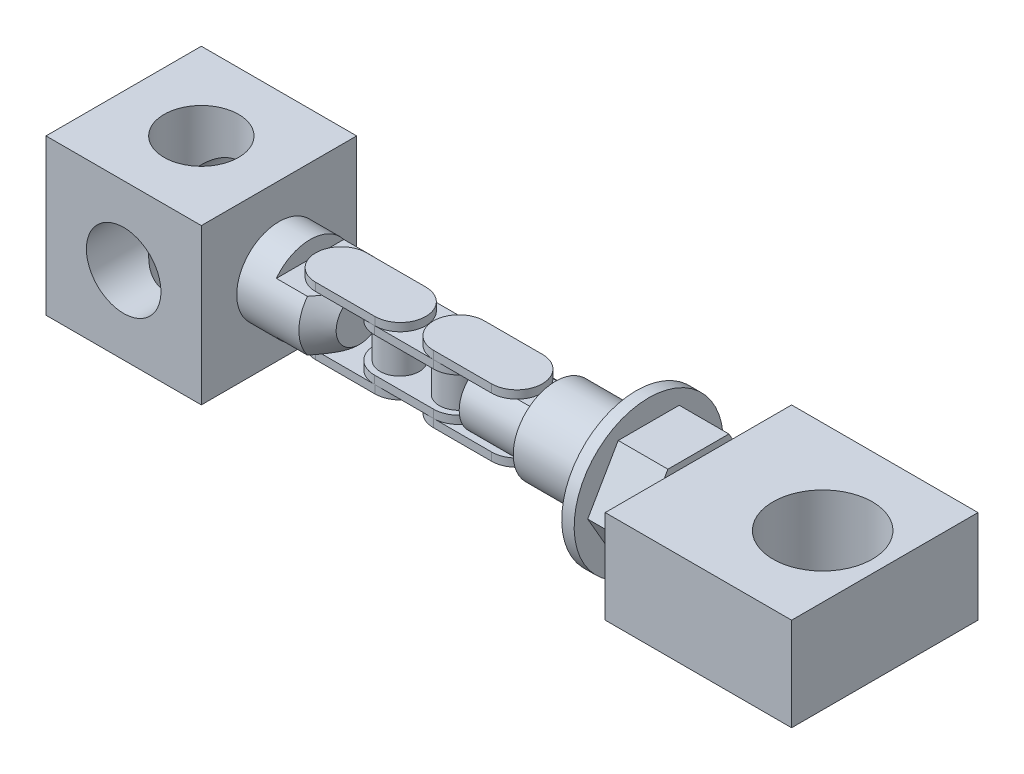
ISO-10303-21;
HEADER;
FILE_DESCRIPTION(('STEP AP214'),'2;1');
FILE_NAME('part.step','',(''),(''),'','','');
FILE_SCHEMA(('AUTOMOTIVE_DESIGN { 1 0 10303 214 1 1 1 1 }'));
ENDSEC;
DATA;
#1=APPLICATION_CONTEXT('core data for automotive mechanical design processes');
#2=APPLICATION_PROTOCOL_DEFINITION('international standard','automotive_design',2000,#1);
#3=PRODUCT_CONTEXT('',#1,'mechanical');
#4=PRODUCT('Part','Part','',(#3));
#5=PRODUCT_RELATED_PRODUCT_CATEGORY('part','',(#4));
#6=PRODUCT_DEFINITION_FORMATION('','',#4);
#7=PRODUCT_DEFINITION_CONTEXT('part definition',#1,'design');
#8=PRODUCT_DEFINITION('design','',#6,#7);
#9=PRODUCT_DEFINITION_SHAPE('','',#8);
#10=(LENGTH_UNIT() NAMED_UNIT(*) SI_UNIT(.MILLI.,.METRE.));
#11=(NAMED_UNIT(*) PLANE_ANGLE_UNIT() SI_UNIT($,.RADIAN.));
#12=(NAMED_UNIT(*) SI_UNIT($,.STERADIAN.) SOLID_ANGLE_UNIT());
#13=UNCERTAINTY_MEASURE_WITH_UNIT(LENGTH_MEASURE(1.E-05),#10,'distance_accuracy_value','');
#14=(GEOMETRIC_REPRESENTATION_CONTEXT(3) GLOBAL_UNCERTAINTY_ASSIGNED_CONTEXT((#13)) GLOBAL_UNIT_ASSIGNED_CONTEXT((#10,
#11,#12)) REPRESENTATION_CONTEXT('',''));
#15=CARTESIAN_POINT('',(0.,0.,0.));
#16=DIRECTION('',(0.,0.,1.));
#17=DIRECTION('',(1.,0.,0.));
#18=AXIS2_PLACEMENT_3D('',#15,#16,#17);
#19=CARTESIAN_POINT('',(0.,0.,-2.5));
#20=DIRECTION('',(0.,0.,1.));
#21=DIRECTION('',(-1.,0.,0.));
#22=AXIS2_PLACEMENT_3D('',#19,#20,#21);
#23=CYLINDRICAL_SURFACE('',#22,6.);
#24=CARTESIAN_POINT('',(0.,0.,25.));
#25=DIRECTION('',(0.,0.,1.));
#26=DIRECTION('',(-1.,0.,0.));
#27=AXIS2_PLACEMENT_3D('',#24,#25,#26);
#28=CIRCLE('',#27,6.);
#29=CARTESIAN_POINT('',(-6.,0.,25.));
#30=VERTEX_POINT('',#29);
#31=EDGE_CURVE('E1557',#30,#30,#28,.T.);
#32=ORIENTED_EDGE('',*,*,#31,.T.);
#33=EDGE_LOOP('',(#32));
#34=FACE_BOUND('',#33,.T.);
#35=CARTESIAN_POINT('',(0.,0.,12.5));
#36=DIRECTION('',(0.,0.707106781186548,0.707106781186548));
#37=DIRECTION('',(0.,-0.707106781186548,0.707106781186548));
#38=AXIS2_PLACEMENT_3D('',#35,#36,#37);
#39=ELLIPSE('',#38,8.48528137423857,6.);
#40=CARTESIAN_POINT('',(6.,0.,12.5));
#41=VERTEX_POINT('',#40);
#42=CARTESIAN_POINT('',(-6.,0.,12.5));
#43=VERTEX_POINT('',#42);
#44=EDGE_CURVE('E27',#41,#43,#39,.F.);
#45=ORIENTED_EDGE('',*,*,#44,.T.);
#46=CARTESIAN_POINT('',(0.,0.,12.5));
#47=DIRECTION('',(0.,-0.707106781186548,0.707106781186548));
#48=DIRECTION('',(0.,0.707106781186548,0.707106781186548));
#49=AXIS2_PLACEMENT_3D('',#46,#47,#48);
#50=ELLIPSE('',#49,8.48528137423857,6.);
#51=EDGE_CURVE('E9',#43,#41,#50,.F.);
#52=ORIENTED_EDGE('',*,*,#51,.T.);
#53=EDGE_LOOP('',(#45,#52));
#54=FACE_BOUND('',#53,.T.);
#55=ADVANCED_FACE('F14',(#34,#54),#23,.F.);
#56=CARTESIAN_POINT('',(56.5,4.1,27.5));
#57=DIRECTION('',(0.,-1.,0.));
#58=DIRECTION('',(-1.,0.,0.));
#59=AXIS2_PLACEMENT_3D('',#56,#57,#58);
#60=PLANE('',#59);
#61=CARTESIAN_POINT('',(50.7951173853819,4.1,12.5));
#62=DIRECTION('',(0.,1.,0.));
#63=DIRECTION('',(0.,0.,-1.));
#64=AXIS2_PLACEMENT_3D('',#61,#62,#63);
#65=CIRCLE('',#64,4.1);
#66=CARTESIAN_POINT('',(53.7311010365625,4.1,15.3618176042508));
#67=VERTEX_POINT('',#66);
#68=CARTESIAN_POINT('',(53.7311010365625,4.1,9.63818239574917));
#69=VERTEX_POINT('',#68);
#70=EDGE_CURVE('E35',#67,#69,#65,.T.);
#71=ORIENTED_EDGE('',*,*,#70,.F.);
#72=DIRECTION('',(1.,0.,0.));
#73=VECTOR('',#72,1.);
#74=CARTESIAN_POINT('',(46.5,4.1,15.3618176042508));
#75=LINE('',#74,#73);
#76=CARTESIAN_POINT('',(56.5,4.1,15.3618176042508));
#77=VERTEX_POINT('',#76);
#78=EDGE_CURVE('E473',#77,#67,#75,.F.);
#79=ORIENTED_EDGE('',*,*,#78,.F.);
#80=DIRECTION('',(0.,0.,-1.));
#81=VECTOR('',#80,1.);
#82=CARTESIAN_POINT('',(56.5,4.1,27.5));
#83=LINE('',#82,#81);
#84=CARTESIAN_POINT('',(56.5,4.1,9.63818239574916));
#85=VERTEX_POINT('',#84);
#86=EDGE_CURVE('E475',#77,#85,#83,.T.);
#87=ORIENTED_EDGE('',*,*,#86,.T.);
#88=DIRECTION('',(1.,0.,0.));
#89=VECTOR('',#88,1.);
#90=CARTESIAN_POINT('',(46.5,4.1,9.63818239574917));
#91=LINE('',#90,#89);
#92=EDGE_CURVE('E472',#69,#85,#91,.T.);
#93=ORIENTED_EDGE('',*,*,#92,.F.);
#94=EDGE_LOOP('',(#71,#79,#87,#93));
#95=FACE_BOUND('',#94,.T.);
#96=ADVANCED_FACE('F599',(#95),#60,.F.);
#97=CARTESIAN_POINT('',(57.,0.,12.5));
#98=DIRECTION('',(-1.,0.,0.));
#99=DIRECTION('',(0.,1.,0.));
#100=AXIS2_PLACEMENT_3D('',#97,#98,#99);
#101=PLANE('',#100);
#102=CARTESIAN_POINT('',(57.,0.,12.5));
#103=DIRECTION('',(-1.,0.,0.));
#104=DIRECTION('',(0.,1.,0.));
#105=AXIS2_PLACEMENT_3D('',#102,#103,#104);
#106=CIRCLE('',#105,6.8);
#107=CARTESIAN_POINT('',(57.,6.8,12.5));
#108=VERTEX_POINT('',#107);
#109=EDGE_CURVE('E455',#108,#108,#106,.T.);
#110=ORIENTED_EDGE('',*,*,#109,.T.);
#111=EDGE_LOOP('',(#110));
#112=FACE_BOUND('',#111,.T.);
#113=CARTESIAN_POINT('',(57.,0.,12.5));
#114=DIRECTION('',(-1.,0.,0.));
#115=DIRECTION('',(0.,1.,0.));
#116=AXIS2_PLACEMENT_3D('',#113,#114,#115);
#117=CIRCLE('',#116,5.);
#118=CARTESIAN_POINT('',(57.,5.,12.5));
#119=VERTEX_POINT('',#118);
#120=EDGE_CURVE('E464',#119,#119,#117,.T.);
#121=ORIENTED_EDGE('',*,*,#120,.F.);
#122=EDGE_LOOP('',(#121));
#123=FACE_BOUND('',#122,.T.);
#124=ADVANCED_FACE('F606',(#112,#123),#101,.T.);
#125=CARTESIAN_POINT('',(70.,0.,12.5));
#126=DIRECTION('',(-1.,0.,0.));
#127=DIRECTION('',(0.,1.,0.));
#128=AXIS2_PLACEMENT_3D('',#125,#126,#127);
#129=PLANE('',#128);
#130=CARTESIAN_POINT('',(70.,0.,12.5));
#131=DIRECTION('',(-1.,0.,0.));
#132=DIRECTION('',(0.,1.,0.));
#133=AXIS2_PLACEMENT_3D('',#130,#131,#132);
#134=CIRCLE('',#133,12.);
#135=CARTESIAN_POINT('',(70.,12.,12.5));
#136=VERTEX_POINT('',#135);
#137=EDGE_CURVE('E435',#136,#136,#134,.T.);
#138=ORIENTED_EDGE('',*,*,#137,.T.);
#139=EDGE_LOOP('',(#138));
#140=FACE_BOUND('',#139,.T.);
#141=CARTESIAN_POINT('',(70.,0.,12.5));
#142=DIRECTION('',(-1.,0.,0.));
#143=DIRECTION('',(0.,1.,0.));
#144=AXIS2_PLACEMENT_3D('',#141,#142,#143);
#145=CIRCLE('',#144,6.8);
#146=CARTESIAN_POINT('',(70.,6.8,12.5));
#147=VERTEX_POINT('',#146);
#148=EDGE_CURVE('E458',#147,#147,#145,.T.);
#149=ORIENTED_EDGE('',*,*,#148,.F.);
#150=EDGE_LOOP('',(#149));
#151=FACE_BOUND('',#150,.T.);
#152=ADVANCED_FACE('F656',(#140,#151),#129,.T.);
#153=CARTESIAN_POINT('',(80.,-7.5,27.5));
#154=DIRECTION('',(1.,0.,0.));
#155=DIRECTION('',(0.,-1.,0.));
#156=AXIS2_PLACEMENT_3D('',#153,#154,#155);
#157=PLANE('',#156);
#158=DIRECTION('',(0.,0.866025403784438,-0.5));
#159=VECTOR('',#158,1.);
#160=CARTESIAN_POINT('',(80.,0.,22.3149545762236));
#161=LINE('',#160,#159);
#162=CARTESIAN_POINT('',(80.,0.,22.3149545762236));
#163=VERTEX_POINT('',#162);
#164=CARTESIAN_POINT('',(80.,7.5,17.9848275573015));
#165=VERTEX_POINT('',#164);
#166=EDGE_CURVE('E419',#163,#165,#161,.T.);
#167=ORIENTED_EDGE('',*,*,#166,.F.);
#168=DIRECTION('',(0.,0.866025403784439,0.5));
#169=VECTOR('',#168,1.);
#170=CARTESIAN_POINT('',(80.,-8.5,17.4074772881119));
#171=LINE('',#170,#169);
#172=CARTESIAN_POINT('',(80.,-7.5,17.9848275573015));
#173=VERTEX_POINT('',#172);
#174=EDGE_CURVE('E359',#173,#163,#171,.T.);
#175=ORIENTED_EDGE('',*,*,#174,.F.);
#176=DIRECTION('',(0.,0.,-1.));
#177=VECTOR('',#176,1.);
#178=CARTESIAN_POINT('',(80.,-7.5,27.5));
#179=LINE('',#178,#177);
#180=CARTESIAN_POINT('',(80.,-7.5,27.5));
#181=VERTEX_POINT('',#180);
#182=EDGE_CURVE('E391',#181,#173,#179,.T.);
#183=ORIENTED_EDGE('',*,*,#182,.F.);
#184=DIRECTION('',(0.,1.,0.));
#185=VECTOR('',#184,1.);
#186=CARTESIAN_POINT('',(80.,-7.5,27.5));
#187=LINE('',#186,#185);
#188=CARTESIAN_POINT('',(80.,7.5,27.5));
#189=VERTEX_POINT('',#188);
#190=EDGE_CURVE('E360',#181,#189,#187,.T.);
#191=ORIENTED_EDGE('',*,*,#190,.T.);
#192=DIRECTION('',(0.,0.,-1.));
#193=VECTOR('',#192,1.);
#194=CARTESIAN_POINT('',(80.,7.5,27.5));
#195=LINE('',#194,#193);
#196=EDGE_CURVE('E379',#189,#165,#195,.T.);
#197=ORIENTED_EDGE('',*,*,#196,.T.);
#198=EDGE_LOOP('',(#167,#175,#183,#191,#197));
#199=FACE_BOUND('',#198,.T.);
#200=ADVANCED_FACE('F664',(#199),#157,.F.);
#201=DIRECTION('',(0.,-0.866025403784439,-0.5));
#202=VECTOR('',#201,1.);
#203=CARTESIAN_POINT('',(80.,8.5,7.59252271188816));
#204=LINE('',#203,#202);
#205=CARTESIAN_POINT('',(80.,7.5,7.01517244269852));
#206=VERTEX_POINT('',#205);
#207=CARTESIAN_POINT('',(80.,0.,2.68504542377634));
#208=VERTEX_POINT('',#207);
#209=EDGE_CURVE('E363',#206,#208,#204,.T.);
#210=ORIENTED_EDGE('',*,*,#209,.F.);
#211=CARTESIAN_POINT('',(80.,7.5,-2.5));
#212=VERTEX_POINT('',#211);
#213=EDGE_CURVE('E383',#206,#212,#195,.T.);
#214=ORIENTED_EDGE('',*,*,#213,.T.);
#215=DIRECTION('',(0.,1.,0.));
#216=VECTOR('',#215,1.);
#217=CARTESIAN_POINT('',(80.,-7.5,-2.5));
#218=LINE('',#217,#216);
#219=CARTESIAN_POINT('',(80.,-7.5,-2.5));
#220=VERTEX_POINT('',#219);
#221=EDGE_CURVE('E364',#220,#212,#218,.T.);
#222=ORIENTED_EDGE('',*,*,#221,.F.);
#223=CARTESIAN_POINT('',(80.,-7.5,7.01517244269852));
#224=VERTEX_POINT('',#223);
#225=EDGE_CURVE('E395',#224,#220,#179,.T.);
#226=ORIENTED_EDGE('',*,*,#225,.F.);
#227=DIRECTION('',(0.,-0.866025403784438,0.5));
#228=VECTOR('',#227,1.);
#229=CARTESIAN_POINT('',(80.,0.,2.68504542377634));
#230=LINE('',#229,#228);
#231=EDGE_CURVE('E428',#208,#224,#230,.T.);
#232=ORIENTED_EDGE('',*,*,#231,.F.);
#233=EDGE_LOOP('',(#210,#214,#222,#226,#232));
#234=FACE_BOUND('',#233,.T.);
#235=ADVANCED_FACE('F718',(#234),#157,.F.);
#236=CARTESIAN_POINT('',(110.,-7.5,27.5));
#237=DIRECTION('',(0.,0.,-1.));
#238=DIRECTION('',(1.,0.,0.));
#239=AXIS2_PLACEMENT_3D('',#236,#237,#238);
#240=PLANE('',#239);
#241=DIRECTION('',(-1.,0.,0.));
#242=VECTOR('',#241,1.);
#243=CARTESIAN_POINT('',(110.,7.5,27.5));
#244=LINE('',#243,#242);
#245=CARTESIAN_POINT('',(110.,7.5,27.5));
#246=VERTEX_POINT('',#245);
#247=EDGE_CURVE('E384',#246,#189,#244,.T.);
#248=ORIENTED_EDGE('',*,*,#247,.T.);
#249=ORIENTED_EDGE('',*,*,#190,.F.);
#250=DIRECTION('',(-1.,0.,0.));
#251=VECTOR('',#250,1.);
#252=CARTESIAN_POINT('',(110.,-7.5,27.5));
#253=LINE('',#252,#251);
#254=CARTESIAN_POINT('',(110.,-7.5,27.5));
#255=VERTEX_POINT('',#254);
#256=EDGE_CURVE('E376',#255,#181,#253,.T.);
#257=ORIENTED_EDGE('',*,*,#256,.F.);
#258=DIRECTION('',(0.,1.,0.));
#259=VECTOR('',#258,1.);
#260=CARTESIAN_POINT('',(110.,-7.5,27.5));
#261=LINE('',#260,#259);
#262=EDGE_CURVE('E370',#255,#246,#261,.T.);
#263=ORIENTED_EDGE('',*,*,#262,.T.);
#264=EDGE_LOOP('',(#248,#249,#257,#263));
#265=FACE_BOUND('',#264,.T.);
#266=ADVANCED_FACE('F16',(#265),#240,.F.);
#267=CARTESIAN_POINT('',(110.,-7.5,-2.5));
#268=DIRECTION('',(0.,0.,1.));
#269=DIRECTION('',(-1.,0.,0.));
#270=AXIS2_PLACEMENT_3D('',#267,#268,#269);
#271=PLANE('',#270);
#272=DIRECTION('',(1.,0.,0.));
#273=VECTOR('',#272,1.);
#274=CARTESIAN_POINT('',(110.,7.5,-2.5));
#275=LINE('',#274,#273);
#276=CARTESIAN_POINT('',(110.,7.5,-2.5));
#277=VERTEX_POINT('',#276);
#278=EDGE_CURVE('E377',#212,#277,#275,.T.);
#279=ORIENTED_EDGE('',*,*,#278,.T.);
#280=DIRECTION('',(0.,1.,0.));
#281=VECTOR('',#280,1.);
#282=CARTESIAN_POINT('',(110.,-7.5,-2.5));
#283=LINE('',#282,#281);
#284=CARTESIAN_POINT('',(110.,-7.5,-2.5));
#285=VERTEX_POINT('',#284);
#286=EDGE_CURVE('E367',#285,#277,#283,.T.);
#287=ORIENTED_EDGE('',*,*,#286,.F.);
#288=DIRECTION('',(1.,0.,0.));
#289=VECTOR('',#288,1.);
#290=CARTESIAN_POINT('',(110.,-7.5,-2.5));
#291=LINE('',#290,#289);
#292=EDGE_CURVE('E389',#220,#285,#291,.T.);
#293=ORIENTED_EDGE('',*,*,#292,.F.);
#294=ORIENTED_EDGE('',*,*,#221,.T.);
#295=EDGE_LOOP('',(#279,#287,#293,#294));
#296=FACE_BOUND('',#295,.T.);
#297=ADVANCED_FACE('F713',(#296),#271,.F.);
#298=CARTESIAN_POINT('',(110.,-7.5,27.5));
#299=DIRECTION('',(-1.,0.,0.));
#300=DIRECTION('',(0.,1.,0.));
#301=AXIS2_PLACEMENT_3D('',#298,#299,#300);
#302=PLANE('',#301);
#303=DIRECTION('',(0.,0.,1.));
#304=VECTOR('',#303,1.);
#305=CARTESIAN_POINT('',(110.,7.5,27.5));
#306=LINE('',#305,#304);
#307=EDGE_CURVE('E374',#277,#246,#306,.T.);
#308=ORIENTED_EDGE('',*,*,#307,.T.);
#309=ORIENTED_EDGE('',*,*,#262,.F.);
#310=DIRECTION('',(0.,0.,1.));
#311=VECTOR('',#310,1.);
#312=CARTESIAN_POINT('',(110.,-7.5,27.5));
#313=LINE('',#312,#311);
#314=EDGE_CURVE('E373',#285,#255,#313,.T.);
#315=ORIENTED_EDGE('',*,*,#314,.F.);
#316=ORIENTED_EDGE('',*,*,#286,.T.);
#317=EDGE_LOOP('',(#308,#309,#315,#316));
#318=FACE_BOUND('',#317,.T.);
#319=ADVANCED_FACE('F706',(#318),#302,.F.);
#320=CARTESIAN_POINT('',(80.,-7.5,27.5));
#321=DIRECTION('',(0.,-1.,0.));
#322=DIRECTION('',(0.,0.,-1.));
#323=AXIS2_PLACEMENT_3D('',#320,#321,#322);
#324=PLANE('',#323);
#325=CARTESIAN_POINT('',(100.,-7.5,12.5));
#326=DIRECTION('',(0.,-1.,0.));
#327=DIRECTION('',(0.,0.,-1.));
#328=AXIS2_PLACEMENT_3D('',#325,#326,#327);
#329=CIRCLE('',#328,8.);
#330=CARTESIAN_POINT('',(100.,-7.5,4.5));
#331=VERTEX_POINT('',#330);
#332=EDGE_CURVE('E491',#331,#331,#329,.T.);
#333=ORIENTED_EDGE('',*,*,#332,.F.);
#334=EDGE_LOOP('',(#333));
#335=FACE_BOUND('',#334,.T.);
#336=ORIENTED_EDGE('',*,*,#256,.T.);
#337=ORIENTED_EDGE('',*,*,#182,.T.);
#338=EDGE_CURVE('E394',#173,#224,#179,.T.);
#339=ORIENTED_EDGE('',*,*,#338,.T.);
#340=ORIENTED_EDGE('',*,*,#225,.T.);
#341=ORIENTED_EDGE('',*,*,#292,.T.);
#342=ORIENTED_EDGE('',*,*,#314,.T.);
#343=EDGE_LOOP('',(#336,#337,#339,#340,#341,#342));
#344=FACE_BOUND('',#343,.T.);
#345=ADVANCED_FACE('F702',(#335,#344),#324,.T.);
#346=CARTESIAN_POINT('',(80.,7.5,27.5));
#347=DIRECTION('',(0.,-1.,0.));
#348=DIRECTION('',(0.,0.,-1.));
#349=AXIS2_PLACEMENT_3D('',#346,#347,#348);
#350=PLANE('',#349);
#351=CARTESIAN_POINT('',(100.,7.5,12.5));
#352=DIRECTION('',(0.,-1.,0.));
#353=DIRECTION('',(0.,0.,-1.));
#354=AXIS2_PLACEMENT_3D('',#351,#352,#353);
#355=CIRCLE('',#354,8.);
#356=CARTESIAN_POINT('',(100.,7.5,4.5));
#357=VERTEX_POINT('',#356);
#358=EDGE_CURVE('E488',#357,#357,#355,.T.);
#359=ORIENTED_EDGE('',*,*,#358,.T.);
#360=EDGE_LOOP('',(#359));
#361=FACE_BOUND('',#360,.T.);
#362=ORIENTED_EDGE('',*,*,#247,.F.);
#363=ORIENTED_EDGE('',*,*,#307,.F.);
#364=ORIENTED_EDGE('',*,*,#278,.F.);
#365=ORIENTED_EDGE('',*,*,#213,.F.);
#366=EDGE_CURVE('E382',#165,#206,#195,.T.);
#367=ORIENTED_EDGE('',*,*,#366,.F.);
#368=ORIENTED_EDGE('',*,*,#196,.F.);
#369=EDGE_LOOP('',(#362,#363,#364,#365,#367,#368));
#370=FACE_BOUND('',#369,.T.);
#371=ADVANCED_FACE('F705',(#361,#370),#350,.F.);
#372=CARTESIAN_POINT('',(80.,0.,2.68504542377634));
#373=DIRECTION('',(-1.,0.,0.));
#374=DIRECTION('',(0.,1.,0.));
#375=AXIS2_PLACEMENT_3D('',#372,#373,#374);
#376=PLANE('',#375);
#377=CARTESIAN_POINT('',(80.,8.5,17.4074772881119));
#378=VERTEX_POINT('',#377);
#379=EDGE_CURVE('E422',#165,#378,#161,.T.);
#380=ORIENTED_EDGE('',*,*,#379,.F.);
#381=ORIENTED_EDGE('',*,*,#366,.T.);
#382=CARTESIAN_POINT('',(80.,8.5,7.59252271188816));
#383=VERTEX_POINT('',#382);
#384=EDGE_CURVE('E432',#383,#206,#204,.T.);
#385=ORIENTED_EDGE('',*,*,#384,.F.);
#386=DIRECTION('',(0.,0.,-1.));
#387=VECTOR('',#386,1.);
#388=CARTESIAN_POINT('',(80.,8.5,17.4074772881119));
#389=LINE('',#388,#387);
#390=EDGE_CURVE('E416',#378,#383,#389,.T.);
#391=ORIENTED_EDGE('',*,*,#390,.F.);
#392=EDGE_LOOP('',(#380,#381,#385,#391));
#393=FACE_BOUND('',#392,.T.);
#394=ADVANCED_FACE('F678',(#393),#376,.F.);
#395=CARTESIAN_POINT('',(72.,8.5,7.59252271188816));
#396=DIRECTION('',(0.,-0.5,0.866025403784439));
#397=DIRECTION('',(0.,-0.866025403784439,-0.5));
#398=AXIS2_PLACEMENT_3D('',#395,#396,#397);
#399=PLANE('',#398);
#400=ORIENTED_EDGE('',*,*,#384,.T.);
#401=ORIENTED_EDGE('',*,*,#209,.T.);
#402=DIRECTION('',(1.,0.,0.));
#403=VECTOR('',#402,1.);
#404=CARTESIAN_POINT('',(72.,0.,2.68504542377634));
#405=LINE('',#404,#403);
#406=CARTESIAN_POINT('',(72.,0.,2.68504542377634));
#407=VERTEX_POINT('',#406);
#408=EDGE_CURVE('E387',#407,#208,#405,.T.);
#409=ORIENTED_EDGE('',*,*,#408,.F.);
#410=DIRECTION('',(0.,-0.866025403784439,-0.5));
#411=VECTOR('',#410,1.);
#412=CARTESIAN_POINT('',(72.,8.5,7.59252271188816));
#413=LINE('',#412,#411);
#414=CARTESIAN_POINT('',(72.,8.5,7.59252271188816));
#415=VERTEX_POINT('',#414);
#416=EDGE_CURVE('E418',#415,#407,#413,.T.);
#417=ORIENTED_EDGE('',*,*,#416,.F.);
#418=DIRECTION('',(1.,0.,0.));
#419=VECTOR('',#418,1.);
#420=CARTESIAN_POINT('',(72.,8.5,7.59252271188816));
#421=LINE('',#420,#419);
#422=EDGE_CURVE('E412',#415,#383,#421,.T.);
#423=ORIENTED_EDGE('',*,*,#422,.T.);
#424=EDGE_LOOP('',(#400,#401,#409,#417,#423));
#425=FACE_BOUND('',#424,.T.);
#426=ADVANCED_FACE('F697',(#425),#399,.F.);
#427=CARTESIAN_POINT('',(72.,0.,2.68504542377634));
#428=DIRECTION('',(0.,0.5,0.866025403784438));
#429=DIRECTION('',(0.,-0.866025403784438,0.5));
#430=AXIS2_PLACEMENT_3D('',#427,#428,#429);
#431=PLANE('',#430);
#432=ORIENTED_EDGE('',*,*,#231,.T.);
#433=CARTESIAN_POINT('',(80.,-8.5,7.59252271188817));
#434=VERTEX_POINT('',#433);
#435=EDGE_CURVE('E431',#224,#434,#230,.T.);
#436=ORIENTED_EDGE('',*,*,#435,.T.);
#437=DIRECTION('',(1.,0.,0.));
#438=VECTOR('',#437,1.);
#439=CARTESIAN_POINT('',(72.,-8.5,7.59252271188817));
#440=LINE('',#439,#438);
#441=CARTESIAN_POINT('',(72.,-8.5,7.59252271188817));
#442=VERTEX_POINT('',#441);
#443=EDGE_CURVE('E400',#442,#434,#440,.T.);
#444=ORIENTED_EDGE('',*,*,#443,.F.);
#445=DIRECTION('',(0.,-0.866025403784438,0.5));
#446=VECTOR('',#445,1.);
#447=CARTESIAN_POINT('',(72.,0.,2.68504542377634));
#448=LINE('',#447,#446);
#449=EDGE_CURVE('E447',#407,#442,#448,.T.);
#450=ORIENTED_EDGE('',*,*,#449,.F.);
#451=ORIENTED_EDGE('',*,*,#408,.T.);
#452=EDGE_LOOP('',(#432,#436,#444,#450,#451));
#453=FACE_BOUND('',#452,.T.);
#454=ADVANCED_FACE('F693',(#453),#431,.F.);
#455=CARTESIAN_POINT('',(72.,-8.5,7.59252271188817));
#456=DIRECTION('',(0.,1.,0.));
#457=DIRECTION('',(0.,0.,1.));
#458=AXIS2_PLACEMENT_3D('',#455,#456,#457);
#459=PLANE('',#458);
#460=DIRECTION('',(0.,0.,1.));
#461=VECTOR('',#460,1.);
#462=CARTESIAN_POINT('',(80.,-8.5,7.59252271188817));
#463=LINE('',#462,#461);
#464=CARTESIAN_POINT('',(80.,-8.5,17.4074772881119));
#465=VERTEX_POINT('',#464);
#466=EDGE_CURVE('E426',#434,#465,#463,.T.);
#467=ORIENTED_EDGE('',*,*,#466,.T.);
#468=DIRECTION('',(1.,0.,0.));
#469=VECTOR('',#468,1.);
#470=CARTESIAN_POINT('',(72.,-8.5,17.4074772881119));
#471=LINE('',#470,#469);
#472=CARTESIAN_POINT('',(72.,-8.5,17.4074772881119));
#473=VERTEX_POINT('',#472);
#474=EDGE_CURVE('E403',#473,#465,#471,.T.);
#475=ORIENTED_EDGE('',*,*,#474,.F.);
#476=DIRECTION('',(0.,0.,1.));
#477=VECTOR('',#476,1.);
#478=CARTESIAN_POINT('',(72.,-8.5,7.59252271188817));
#479=LINE('',#478,#477);
#480=EDGE_CURVE('E444',#442,#473,#479,.T.);
#481=ORIENTED_EDGE('',*,*,#480,.F.);
#482=ORIENTED_EDGE('',*,*,#443,.T.);
#483=EDGE_LOOP('',(#467,#475,#481,#482));
#484=FACE_BOUND('',#483,.T.);
#485=ADVANCED_FACE('F689',(#484),#459,.F.);
#486=CARTESIAN_POINT('',(72.,-8.5,17.4074772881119));
#487=DIRECTION('',(0.,0.5,-0.866025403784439));
#488=DIRECTION('',(0.,0.866025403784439,0.5));
#489=AXIS2_PLACEMENT_3D('',#486,#487,#488);
#490=PLANE('',#489);
#491=EDGE_CURVE('E423',#465,#173,#171,.T.);
#492=ORIENTED_EDGE('',*,*,#491,.T.);
#493=ORIENTED_EDGE('',*,*,#174,.T.);
#494=DIRECTION('',(1.,0.,0.));
#495=VECTOR('',#494,1.);
#496=CARTESIAN_POINT('',(72.,0.,22.3149545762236));
#497=LINE('',#496,#495);
#498=CARTESIAN_POINT('',(72.,0.,22.3149545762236));
#499=VERTEX_POINT('',#498);
#500=EDGE_CURVE('E406',#499,#163,#497,.T.);
#501=ORIENTED_EDGE('',*,*,#500,.F.);
#502=DIRECTION('',(0.,0.866025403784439,0.5));
#503=VECTOR('',#502,1.);
#504=CARTESIAN_POINT('',(72.,-8.5,17.4074772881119));
#505=LINE('',#504,#503);
#506=EDGE_CURVE('E441',#473,#499,#505,.T.);
#507=ORIENTED_EDGE('',*,*,#506,.F.);
#508=ORIENTED_EDGE('',*,*,#474,.T.);
#509=EDGE_LOOP('',(#492,#493,#501,#507,#508));
#510=FACE_BOUND('',#509,.T.);
#511=ADVANCED_FACE('F685',(#510),#490,.F.);
#512=CARTESIAN_POINT('',(72.,0.,22.3149545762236));
#513=DIRECTION('',(0.,-0.5,-0.866025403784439));
#514=DIRECTION('',(0.,0.866025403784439,-0.5));
#515=AXIS2_PLACEMENT_3D('',#512,#513,#514);
#516=PLANE('',#515);
#517=ORIENTED_EDGE('',*,*,#166,.T.);
#518=ORIENTED_EDGE('',*,*,#379,.T.);
#519=DIRECTION('',(1.,0.,0.));
#520=VECTOR('',#519,1.);
#521=CARTESIAN_POINT('',(72.,8.5,17.4074772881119));
#522=LINE('',#521,#520);
#523=CARTESIAN_POINT('',(72.,8.5,17.4074772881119));
#524=VERTEX_POINT('',#523);
#525=EDGE_CURVE('E409',#524,#378,#522,.T.);
#526=ORIENTED_EDGE('',*,*,#525,.F.);
#527=DIRECTION('',(0.,0.866025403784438,-0.5));
#528=VECTOR('',#527,1.);
#529=CARTESIAN_POINT('',(72.,0.,22.3149545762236));
#530=LINE('',#529,#528);
#531=EDGE_CURVE('E438',#499,#524,#530,.T.);
#532=ORIENTED_EDGE('',*,*,#531,.F.);
#533=ORIENTED_EDGE('',*,*,#500,.T.);
#534=EDGE_LOOP('',(#517,#518,#526,#532,#533));
#535=FACE_BOUND('',#534,.T.);
#536=ADVANCED_FACE('F681',(#535),#516,.F.);
#537=CARTESIAN_POINT('',(72.,8.5,17.4074772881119));
#538=DIRECTION('',(0.,-1.,0.));
#539=DIRECTION('',(0.,0.,-1.));
#540=AXIS2_PLACEMENT_3D('',#537,#538,#539);
#541=PLANE('',#540);
#542=ORIENTED_EDGE('',*,*,#390,.T.);
#543=ORIENTED_EDGE('',*,*,#422,.F.);
#544=DIRECTION('',(0.,0.,-1.));
#545=VECTOR('',#544,1.);
#546=CARTESIAN_POINT('',(72.,8.5,17.4074772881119));
#547=LINE('',#546,#545);
#548=EDGE_CURVE('E415',#524,#415,#547,.T.);
#549=ORIENTED_EDGE('',*,*,#548,.F.);
#550=ORIENTED_EDGE('',*,*,#525,.T.);
#551=EDGE_LOOP('',(#542,#543,#549,#550));
#552=FACE_BOUND('',#551,.T.);
#553=ADVANCED_FACE('F676',(#552),#541,.F.);
#554=ORIENTED_EDGE('',*,*,#338,.F.);
#555=ORIENTED_EDGE('',*,*,#491,.F.);
#556=ORIENTED_EDGE('',*,*,#466,.F.);
#557=ORIENTED_EDGE('',*,*,#435,.F.);
#558=EDGE_LOOP('',(#554,#555,#556,#557));
#559=FACE_BOUND('',#558,.T.);
#560=ADVANCED_FACE('F669',(#559),#376,.F.);
#561=CARTESIAN_POINT('',(72.,0.,12.5));
#562=DIRECTION('',(-1.,0.,0.));
#563=DIRECTION('',(0.,1.,0.));
#564=AXIS2_PLACEMENT_3D('',#561,#562,#563);
#565=PLANE('',#564);
#566=CARTESIAN_POINT('',(72.,0.,12.5));
#567=DIRECTION('',(-1.,0.,0.));
#568=DIRECTION('',(0.,1.,0.));
#569=AXIS2_PLACEMENT_3D('',#566,#567,#568);
#570=CIRCLE('',#569,12.);
#571=CARTESIAN_POINT('',(72.,12.,12.5));
#572=VERTEX_POINT('',#571);
#573=EDGE_CURVE('E452',#572,#572,#570,.T.);
#574=ORIENTED_EDGE('',*,*,#573,.F.);
#575=EDGE_LOOP('',(#574));
#576=FACE_BOUND('',#575,.T.);
#577=ORIENTED_EDGE('',*,*,#548,.T.);
#578=ORIENTED_EDGE('',*,*,#416,.T.);
#579=ORIENTED_EDGE('',*,*,#449,.T.);
#580=ORIENTED_EDGE('',*,*,#480,.T.);
#581=ORIENTED_EDGE('',*,*,#506,.T.);
#582=ORIENTED_EDGE('',*,*,#531,.T.);
#583=EDGE_LOOP('',(#577,#578,#579,#580,#581,#582));
#584=FACE_BOUND('',#583,.T.);
#585=ADVANCED_FACE('F666',(#576,#584),#565,.F.);
#586=CARTESIAN_POINT('',(70.,0.,12.5));
#587=DIRECTION('',(1.,0.,0.));
#588=DIRECTION('',(0.,-1.,0.));
#589=AXIS2_PLACEMENT_3D('',#586,#587,#588);
#590=CYLINDRICAL_SURFACE('',#589,12.);
#591=ORIENTED_EDGE('',*,*,#137,.F.);
#592=EDGE_LOOP('',(#591));
#593=FACE_BOUND('',#592,.T.);
#594=ORIENTED_EDGE('',*,*,#573,.T.);
#595=EDGE_LOOP('',(#594));
#596=FACE_BOUND('',#595,.T.);
#597=ADVANCED_FACE('F660',(#593,#596),#590,.T.);
#598=CARTESIAN_POINT('',(57.,0.,12.5));
#599=DIRECTION('',(1.,0.,0.));
#600=DIRECTION('',(0.,-1.,0.));
#601=AXIS2_PLACEMENT_3D('',#598,#599,#600);
#602=CYLINDRICAL_SURFACE('',#601,6.8);
#603=ORIENTED_EDGE('',*,*,#109,.F.);
#604=EDGE_LOOP('',(#603));
#605=FACE_BOUND('',#604,.T.);
#606=ORIENTED_EDGE('',*,*,#148,.T.);
#607=EDGE_LOOP('',(#606));
#608=FACE_BOUND('',#607,.T.);
#609=ADVANCED_FACE('F652',(#605,#608),#602,.T.);
#610=CARTESIAN_POINT('',(46.5,0.,12.5));
#611=DIRECTION('',(1.,0.,0.));
#612=DIRECTION('',(0.,-1.,0.));
#613=AXIS2_PLACEMENT_3D('',#610,#611,#612);
#614=CYLINDRICAL_SURFACE('',#613,5.);
#615=CARTESIAN_POINT('',(46.5,0.,12.5));
#616=DIRECTION('',(-1.,0.,0.));
#617=DIRECTION('',(0.,1.,0.));
#618=AXIS2_PLACEMENT_3D('',#615,#616,#617);
#619=CIRCLE('',#618,5.);
#620=CARTESIAN_POINT('',(46.5,-4.1,15.3618176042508));
#621=VERTEX_POINT('',#620);
#622=CARTESIAN_POINT('',(46.5,4.1,15.3618176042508));
#623=VERTEX_POINT('',#622);
#624=EDGE_CURVE('E467',#621,#623,#619,.T.);
#625=ORIENTED_EDGE('',*,*,#624,.F.);
#626=DIRECTION('',(1.,0.,0.));
#627=VECTOR('',#626,1.);
#628=CARTESIAN_POINT('',(46.5,-4.1,15.3618176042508));
#629=LINE('',#628,#627);
#630=CARTESIAN_POINT('',(53.7311010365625,-4.1,15.3618176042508));
#631=VERTEX_POINT('',#630);
#632=EDGE_CURVE('E478',#621,#631,#629,.T.);
#633=ORIENTED_EDGE('',*,*,#632,.T.);
#634=CARTESIAN_POINT('',(56.5,-4.1,15.3618176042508));
#635=VERTEX_POINT('',#634);
#636=EDGE_CURVE('E481',#631,#635,#629,.T.);
#637=ORIENTED_EDGE('',*,*,#636,.T.);
#638=CARTESIAN_POINT('',(56.5,0.,12.5));
#639=DIRECTION('',(1.,0.,0.));
#640=DIRECTION('',(0.,-1.,0.));
#641=AXIS2_PLACEMENT_3D('',#638,#639,#640);
#642=CIRCLE('',#641,5.);
#643=CARTESIAN_POINT('',(56.5,-4.1,9.63818239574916));
#644=VERTEX_POINT('',#643);
#645=EDGE_CURVE('E345',#635,#644,#642,.T.);
#646=ORIENTED_EDGE('',*,*,#645,.T.);
#647=DIRECTION('',(1.,0.,0.));
#648=VECTOR('',#647,1.);
#649=CARTESIAN_POINT('',(46.5,-4.1,9.63818239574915));
#650=LINE('',#649,#648);
#651=CARTESIAN_POINT('',(53.7311010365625,-4.1,9.63818239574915));
#652=VERTEX_POINT('',#651);
#653=EDGE_CURVE('E482',#644,#652,#650,.F.);
#654=ORIENTED_EDGE('',*,*,#653,.T.);
#655=DIRECTION('',(1.,0.,0.));
#656=VECTOR('',#655,1.);
#657=CARTESIAN_POINT('',(46.5,-4.1,9.63818239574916));
#658=LINE('',#657,#656);
#659=CARTESIAN_POINT('',(46.5,-4.1,9.63818239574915));
#660=VERTEX_POINT('',#659);
#661=EDGE_CURVE('E494',#652,#660,#658,.F.);
#662=ORIENTED_EDGE('',*,*,#661,.T.);
#663=CARTESIAN_POINT('',(46.5,4.1,9.63818239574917));
#664=VERTEX_POINT('',#663);
#665=EDGE_CURVE('E461',#664,#660,#619,.T.);
#666=ORIENTED_EDGE('',*,*,#665,.F.);
#667=EDGE_CURVE('E468',#664,#69,#91,.T.);
#668=ORIENTED_EDGE('',*,*,#667,.T.);
#669=ORIENTED_EDGE('',*,*,#92,.T.);
#670=CARTESIAN_POINT('',(56.5,0.,12.5));
#671=DIRECTION('',(1.,0.,0.));
#672=DIRECTION('',(0.,-1.,0.));
#673=AXIS2_PLACEMENT_3D('',#670,#671,#672);
#674=CIRCLE('',#673,5.);
#675=EDGE_CURVE('E353',#85,#77,#674,.T.);
#676=ORIENTED_EDGE('',*,*,#675,.T.);
#677=ORIENTED_EDGE('',*,*,#78,.T.);
#678=DIRECTION('',(1.,0.,0.));
#679=VECTOR('',#678,1.);
#680=CARTESIAN_POINT('',(46.5,4.1,15.3618176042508));
#681=LINE('',#680,#679);
#682=EDGE_CURVE('E497',#67,#623,#681,.F.);
#683=ORIENTED_EDGE('',*,*,#682,.T.);
#684=EDGE_LOOP('',(#625,#633,#637,#646,#654,#662,#666,#668,#669,#676,#677,#683));
#685=FACE_BOUND('',#684,.T.);
#686=ORIENTED_EDGE('',*,*,#120,.T.);
#687=EDGE_LOOP('',(#686));
#688=FACE_BOUND('',#687,.T.);
#689=ADVANCED_FACE('F648',(#685,#688),#614,.T.);
#690=CARTESIAN_POINT('',(46.5,0.,12.5));
#691=DIRECTION('',(-1.,0.,0.));
#692=DIRECTION('',(0.,1.,0.));
#693=AXIS2_PLACEMENT_3D('',#690,#691,#692);
#694=PLANE('',#693);
#695=DIRECTION('',(0.,0.,-1.));
#696=VECTOR('',#695,1.);
#697=CARTESIAN_POINT('',(46.5,-4.1,12.5));
#698=LINE('',#697,#696);
#699=EDGE_CURVE('E351',#621,#660,#698,.T.);
#700=ORIENTED_EDGE('',*,*,#699,.F.);
#701=ORIENTED_EDGE('',*,*,#624,.T.);
#702=DIRECTION('',(0.,0.,1.));
#703=VECTOR('',#702,1.);
#704=CARTESIAN_POINT('',(46.5,4.1,12.5));
#705=LINE('',#704,#703);
#706=EDGE_CURVE('E356',#664,#623,#705,.T.);
#707=ORIENTED_EDGE('',*,*,#706,.F.);
#708=ORIENTED_EDGE('',*,*,#665,.T.);
#709=EDGE_LOOP('',(#700,#701,#707,#708));
#710=FACE_BOUND('',#709,.T.);
#711=ADVANCED_FACE('F643',(#710),#694,.T.);
#712=CARTESIAN_POINT('',(56.5,4.1,27.5));
#713=DIRECTION('',(1.,0.,0.));
#714=DIRECTION('',(0.,-1.,0.));
#715=AXIS2_PLACEMENT_3D('',#712,#713,#714);
#716=PLANE('',#715);
#717=ORIENTED_EDGE('',*,*,#86,.F.);
#718=ORIENTED_EDGE('',*,*,#675,.F.);
#719=EDGE_LOOP('',(#717,#718));
#720=FACE_BOUND('',#719,.T.);
#721=ADVANCED_FACE('F637',(#720),#716,.F.);
#722=CARTESIAN_POINT('',(56.5,-4.1,27.5));
#723=DIRECTION('',(1.,0.,0.));
#724=DIRECTION('',(0.,-1.,0.));
#725=AXIS2_PLACEMENT_3D('',#722,#723,#724);
#726=PLANE('',#725);
#727=ORIENTED_EDGE('',*,*,#645,.F.);
#728=DIRECTION('',(0.,0.,-1.));
#729=VECTOR('',#728,1.);
#730=CARTESIAN_POINT('',(56.5,-4.1,27.5));
#731=LINE('',#730,#729);
#732=EDGE_CURVE('E485',#635,#644,#731,.T.);
#733=ORIENTED_EDGE('',*,*,#732,.T.);
#734=EDGE_LOOP('',(#727,#733));
#735=FACE_BOUND('',#734,.T.);
#736=ADVANCED_FACE('F634',(#735),#726,.F.);
#737=CARTESIAN_POINT('',(56.5,-4.1,27.5));
#738=DIRECTION('',(0.,1.,0.));
#739=DIRECTION('',(1.,0.,0.));
#740=AXIS2_PLACEMENT_3D('',#737,#738,#739);
#741=PLANE('',#740);
#742=ORIENTED_EDGE('',*,*,#636,.F.);
#743=CARTESIAN_POINT('',(50.7951173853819,-4.1,12.5));
#744=DIRECTION('',(0.,1.,0.));
#745=DIRECTION('',(0.,0.,-1.));
#746=AXIS2_PLACEMENT_3D('',#743,#744,#745);
#747=CIRCLE('',#746,4.1);
#748=EDGE_CURVE('E1542',#631,#652,#747,.T.);
#749=ORIENTED_EDGE('',*,*,#748,.T.);
#750=ORIENTED_EDGE('',*,*,#653,.F.);
#751=ORIENTED_EDGE('',*,*,#732,.F.);
#752=EDGE_LOOP('',(#742,#749,#750,#751));
#753=FACE_BOUND('',#752,.T.);
#754=ADVANCED_FACE('F632',(#753),#741,.F.);
#755=CARTESIAN_POINT('',(100.,-7.5,12.5));
#756=DIRECTION('',(0.,-1.,0.));
#757=DIRECTION('',(0.,0.,-1.));
#758=AXIS2_PLACEMENT_3D('',#755,#756,#757);
#759=CYLINDRICAL_SURFACE('',#758,8.);
#760=ORIENTED_EDGE('',*,*,#332,.T.);
#761=EDGE_LOOP('',(#760));
#762=FACE_BOUND('',#761,.T.);
#763=ORIENTED_EDGE('',*,*,#358,.F.);
#764=EDGE_LOOP('',(#763));
#765=FACE_BOUND('',#764,.T.);
#766=ADVANCED_FACE('F628',(#762,#765),#759,.F.);
#767=CARTESIAN_POINT('',(50.7951173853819,-4.1,12.5));
#768=DIRECTION('',(0.,1.,0.));
#769=DIRECTION('',(0.,0.,-1.));
#770=AXIS2_PLACEMENT_3D('',#767,#768,#769);
#771=PLANE('',#770);
#772=ORIENTED_EDGE('',*,*,#632,.F.);
#773=ORIENTED_EDGE('',*,*,#699,.T.);
#774=ORIENTED_EDGE('',*,*,#661,.F.);
#775=CARTESIAN_POINT('',(50.7951173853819,-4.1,8.4));
#776=VERTEX_POINT('',#775);
#777=EDGE_CURVE('E1543',#652,#776,#747,.T.);
#778=ORIENTED_EDGE('',*,*,#777,.T.);
#779=DIRECTION('',(-1.,0.,0.));
#780=VECTOR('',#779,1.);
#781=CARTESIAN_POINT('',(50.7951173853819,-4.1,8.4));
#782=LINE('',#781,#780);
#783=CARTESIAN_POINT('',(41.4628840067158,-4.1,8.4));
#784=VERTEX_POINT('',#783);
#785=EDGE_CURVE('E1530',#776,#784,#782,.T.);
#786=ORIENTED_EDGE('',*,*,#785,.T.);
#787=CARTESIAN_POINT('',(41.4628840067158,-4.1,12.5));
#788=DIRECTION('',(0.,-1.,0.));
#789=DIRECTION('',(0.,0.,1.));
#790=AXIS2_PLACEMENT_3D('',#787,#788,#789);
#791=CIRCLE('',#790,4.1);
#792=CARTESIAN_POINT('',(41.4628840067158,-4.1,16.6));
#793=VERTEX_POINT('',#792);
#794=EDGE_CURVE('E1506',#784,#793,#791,.T.);
#795=ORIENTED_EDGE('',*,*,#794,.T.);
#796=DIRECTION('',(1.,0.,0.));
#797=VECTOR('',#796,1.);
#798=CARTESIAN_POINT('',(50.7951173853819,-4.1,16.6));
#799=LINE('',#798,#797);
#800=CARTESIAN_POINT('',(50.7951173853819,-4.1,16.6));
#801=VERTEX_POINT('',#800);
#802=EDGE_CURVE('E1536',#793,#801,#799,.T.);
#803=ORIENTED_EDGE('',*,*,#802,.T.);
#804=EDGE_CURVE('E1539',#801,#631,#747,.T.);
#805=ORIENTED_EDGE('',*,*,#804,.T.);
#806=EDGE_LOOP('',(#772,#773,#774,#778,#786,#795,#803,#805));
#807=FACE_BOUND('',#806,.T.);
#808=ADVANCED_FACE('F631',(#807),#771,.T.);
#809=CARTESIAN_POINT('',(50.7951173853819,4.1,12.5));
#810=DIRECTION('',(0.,-1.,0.));
#811=DIRECTION('',(0.,0.,-1.));
#812=AXIS2_PLACEMENT_3D('',#809,#810,#811);
#813=PLANE('',#812);
#814=ORIENTED_EDGE('',*,*,#667,.F.);
#815=ORIENTED_EDGE('',*,*,#706,.T.);
#816=ORIENTED_EDGE('',*,*,#682,.F.);
#817=CARTESIAN_POINT('',(50.7951173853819,4.1,16.6));
#818=VERTEX_POINT('',#817);
#819=EDGE_CURVE('E1450',#818,#67,#65,.T.);
#820=ORIENTED_EDGE('',*,*,#819,.F.);
#821=DIRECTION('',(1.,0.,0.));
#822=VECTOR('',#821,1.);
#823=CARTESIAN_POINT('',(50.7951173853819,4.1,16.6));
#824=LINE('',#823,#822);
#825=CARTESIAN_POINT('',(41.4628840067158,4.1,16.6));
#826=VERTEX_POINT('',#825);
#827=EDGE_CURVE('E1441',#826,#818,#824,.T.);
#828=ORIENTED_EDGE('',*,*,#827,.F.);
#829=CARTESIAN_POINT('',(41.4628840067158,4.1,12.5));
#830=DIRECTION('',(0.,-1.,0.));
#831=DIRECTION('',(0.,0.,1.));
#832=AXIS2_PLACEMENT_3D('',#829,#830,#831);
#833=CIRCLE('',#832,4.1);
#834=CARTESIAN_POINT('',(41.4628840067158,4.1,8.4));
#835=VERTEX_POINT('',#834);
#836=EDGE_CURVE('E1418',#835,#826,#833,.T.);
#837=ORIENTED_EDGE('',*,*,#836,.F.);
#838=DIRECTION('',(-1.,0.,0.));
#839=VECTOR('',#838,1.);
#840=CARTESIAN_POINT('',(50.7951173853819,4.1,8.4));
#841=LINE('',#840,#839);
#842=CARTESIAN_POINT('',(50.7951173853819,4.1,8.4));
#843=VERTEX_POINT('',#842);
#844=EDGE_CURVE('E1447',#843,#835,#841,.T.);
#845=ORIENTED_EDGE('',*,*,#844,.F.);
#846=EDGE_CURVE('E1453',#69,#843,#65,.T.);
#847=ORIENTED_EDGE('',*,*,#846,.F.);
#848=EDGE_LOOP('',(#814,#815,#816,#820,#828,#837,#845,#847));
#849=FACE_BOUND('',#848,.T.);
#850=ADVANCED_FACE('F860',(#849),#813,.T.);
#851=CARTESIAN_POINT('',(41.4628840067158,2.8,12.5));
#852=DIRECTION('',(0.,1.,0.));
#853=DIRECTION('',(0.,0.,1.));
#854=AXIS2_PLACEMENT_3D('',#851,#852,#853);
#855=PLANE('',#854);
#856=CARTESIAN_POINT('',(31.9378840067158,2.79999999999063,12.5));
#857=DIRECTION('',(0.,1.,0.));
#858=DIRECTION('',(0.,0.,1.));
#859=AXIS2_PLACEMENT_3D('',#856,#857,#858);
#860=CIRCLE('',#859,3.15);
#861=CARTESIAN_POINT('',(31.9378840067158,2.79999999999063,15.65));
#862=VERTEX_POINT('',#861);
#863=EDGE_CURVE('E505',#862,#862,#860,.F.);
#864=ORIENTED_EDGE('',*,*,#863,.F.);
#865=EDGE_LOOP('',(#864));
#866=FACE_BOUND('',#865,.T.);
#867=CARTESIAN_POINT('',(41.4628840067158,2.8,12.5));
#868=DIRECTION('',(0.,-1.,0.));
#869=DIRECTION('',(0.,0.,1.));
#870=AXIS2_PLACEMENT_3D('',#867,#868,#869);
#871=CIRCLE('',#870,4.1);
#872=CARTESIAN_POINT('',(41.4628840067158,2.8,8.4));
#873=VERTEX_POINT('',#872);
#874=CARTESIAN_POINT('',(41.4628840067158,2.8,16.6));
#875=VERTEX_POINT('',#874);
#876=EDGE_CURVE('E1411',#873,#875,#871,.T.);
#877=ORIENTED_EDGE('',*,*,#876,.T.);
#878=DIRECTION('',(-1.,0.,0.));
#879=VECTOR('',#878,1.);
#880=CARTESIAN_POINT('',(41.4628840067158,2.8,16.6));
#881=LINE('',#880,#879);
#882=CARTESIAN_POINT('',(31.9378840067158,2.8,16.6));
#883=VERTEX_POINT('',#882);
#884=EDGE_CURVE('E1425',#875,#883,#881,.T.);
#885=ORIENTED_EDGE('',*,*,#884,.T.);
#886=CARTESIAN_POINT('',(31.9378840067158,2.8,12.5));
#887=DIRECTION('',(0.,-1.,0.));
#888=DIRECTION('',(0.,0.,-1.));
#889=AXIS2_PLACEMENT_3D('',#886,#887,#888);
#890=CIRCLE('',#889,4.1);
#891=CARTESIAN_POINT('',(31.9378840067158,2.8,8.4));
#892=VERTEX_POINT('',#891);
#893=EDGE_CURVE('E1423',#883,#892,#890,.T.);
#894=ORIENTED_EDGE('',*,*,#893,.T.);
#895=DIRECTION('',(1.,0.,0.));
#896=VECTOR('',#895,1.);
#897=CARTESIAN_POINT('',(41.4628840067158,2.8,8.4));
#898=LINE('',#897,#896);
#899=EDGE_CURVE('E1407',#892,#873,#898,.T.);
#900=ORIENTED_EDGE('',*,*,#899,.T.);
#901=EDGE_LOOP('',(#877,#885,#894,#900));
#902=FACE_BOUND('',#901,.T.);
#903=CARTESIAN_POINT('',(41.4628840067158,2.79999999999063,12.5));
#904=DIRECTION('',(0.,1.,0.));
#905=DIRECTION('',(0.,0.,1.));
#906=AXIS2_PLACEMENT_3D('',#903,#904,#905);
#907=CIRCLE('',#906,3.15);
#908=CARTESIAN_POINT('',(41.4628840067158,2.79999999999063,15.65));
#909=VERTEX_POINT('',#908);
#910=EDGE_CURVE('E499',#909,#909,#907,.F.);
#911=ORIENTED_EDGE('',*,*,#910,.F.);
#912=EDGE_LOOP('',(#911));
#913=FACE_BOUND('',#912,.T.);
#914=ADVANCED_FACE('F869',(#866,#902,#913),#855,.F.);
#915=CARTESIAN_POINT('',(41.4628840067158,-2.8,12.5));
#916=DIRECTION('',(0.,-1.,0.));
#917=DIRECTION('',(0.,0.,1.));
#918=AXIS2_PLACEMENT_3D('',#915,#916,#917);
#919=PLANE('',#918);
#920=CARTESIAN_POINT('',(31.9378840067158,-2.80000000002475,12.5));
#921=DIRECTION('',(0.,-1.,0.));
#922=DIRECTION('',(0.,0.,-1.));
#923=AXIS2_PLACEMENT_3D('',#920,#921,#922);
#924=CIRCLE('',#923,3.15);
#925=CARTESIAN_POINT('',(31.9378840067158,-2.80000000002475,9.35));
#926=VERTEX_POINT('',#925);
#927=EDGE_CURVE('E508',#926,#926,#924,.F.);
#928=ORIENTED_EDGE('',*,*,#927,.F.);
#929=EDGE_LOOP('',(#928));
#930=FACE_BOUND('',#929,.T.);
#931=CARTESIAN_POINT('',(41.4628840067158,-2.8,12.5));
#932=DIRECTION('',(0.,-1.,0.));
#933=DIRECTION('',(0.,0.,1.));
#934=AXIS2_PLACEMENT_3D('',#931,#932,#933);
#935=CIRCLE('',#934,4.1);
#936=CARTESIAN_POINT('',(41.4628840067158,-2.8,8.4));
#937=VERTEX_POINT('',#936);
#938=CARTESIAN_POINT('',(41.4628840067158,-2.8,16.6));
#939=VERTEX_POINT('',#938);
#940=EDGE_CURVE('E1500',#937,#939,#935,.T.);
#941=ORIENTED_EDGE('',*,*,#940,.F.);
#942=DIRECTION('',(1.,0.,0.));
#943=VECTOR('',#942,1.);
#944=CARTESIAN_POINT('',(41.4628840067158,-2.8,8.4));
#945=LINE('',#944,#943);
#946=CARTESIAN_POINT('',(31.9378840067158,-2.8,8.4));
#947=VERTEX_POINT('',#946);
#948=EDGE_CURVE('E1514',#947,#937,#945,.T.);
#949=ORIENTED_EDGE('',*,*,#948,.F.);
#950=CARTESIAN_POINT('',(31.9378840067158,-2.8,12.5));
#951=DIRECTION('',(0.,-1.,0.));
#952=DIRECTION('',(0.,0.,-1.));
#953=AXIS2_PLACEMENT_3D('',#950,#951,#952);
#954=CIRCLE('',#953,4.1);
#955=CARTESIAN_POINT('',(31.9378840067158,-2.8,16.6));
#956=VERTEX_POINT('',#955);
#957=EDGE_CURVE('E1511',#956,#947,#954,.T.);
#958=ORIENTED_EDGE('',*,*,#957,.F.);
#959=DIRECTION('',(-1.,0.,0.));
#960=VECTOR('',#959,1.);
#961=CARTESIAN_POINT('',(41.4628840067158,-2.8,16.6));
#962=LINE('',#961,#960);
#963=EDGE_CURVE('E1496',#939,#956,#962,.T.);
#964=ORIENTED_EDGE('',*,*,#963,.F.);
#965=EDGE_LOOP('',(#941,#949,#958,#964));
#966=FACE_BOUND('',#965,.T.);
#967=CARTESIAN_POINT('',(41.4628840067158,-2.80000000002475,12.5));
#968=DIRECTION('',(0.,-1.,0.));
#969=DIRECTION('',(0.,0.,-1.));
#970=AXIS2_PLACEMENT_3D('',#967,#968,#969);
#971=CIRCLE('',#970,3.15);
#972=CARTESIAN_POINT('',(41.4628840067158,-2.80000000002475,9.35));
#973=VERTEX_POINT('',#972);
#974=EDGE_CURVE('E502',#973,#973,#971,.F.);
#975=ORIENTED_EDGE('',*,*,#974,.F.);
#976=EDGE_LOOP('',(#975));
#977=FACE_BOUND('',#976,.T.);
#978=ADVANCED_FACE('F878',(#930,#966,#977),#919,.F.);
#979=CARTESIAN_POINT('',(41.4628840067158,4.1,12.5));
#980=DIRECTION('',(0.,1.,0.));
#981=DIRECTION('',(0.,0.,1.));
#982=AXIS2_PLACEMENT_3D('',#979,#980,#981);
#983=PLANE('',#982);
#984=DIRECTION('',(-1.,0.,0.));
#985=VECTOR('',#984,1.);
#986=CARTESIAN_POINT('',(41.4628840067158,4.1,16.6));
#987=LINE('',#986,#985);
#988=CARTESIAN_POINT('',(32.025,4.1,16.6));
#989=VERTEX_POINT('',#988);
#990=EDGE_CURVE('E1415',#826,#989,#987,.T.);
#991=ORIENTED_EDGE('',*,*,#990,.F.);
#992=CARTESIAN_POINT('',(41.4628840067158,4.1,12.5));
#993=DIRECTION('',(0.,1.,0.));
#994=DIRECTION('',(0.,0.,1.));
#995=AXIS2_PLACEMENT_3D('',#992,#993,#994);
#996=CIRCLE('',#995,4.1);
#997=EDGE_CURVE('E1444',#835,#826,#996,.T.);
#998=ORIENTED_EDGE('',*,*,#997,.F.);
#999=DIRECTION('',(1.,0.,0.));
#1000=VECTOR('',#999,1.);
#1001=CARTESIAN_POINT('',(41.4628840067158,4.1,8.4));
#1002=LINE('',#1001,#1000);
#1003=CARTESIAN_POINT('',(32.025,4.1,8.4));
#1004=VERTEX_POINT('',#1003);
#1005=EDGE_CURVE('E1408',#1004,#835,#1002,.T.);
#1006=ORIENTED_EDGE('',*,*,#1005,.F.);
#1007=CARTESIAN_POINT('',(32.025,4.1,12.5));
#1008=DIRECTION('',(0.,1.,0.));
#1009=DIRECTION('',(1.,0.,0.));
#1010=AXIS2_PLACEMENT_3D('',#1007,#1008,#1009);
#1011=CIRCLE('',#1010,4.1);
#1012=EDGE_CURVE('E1387',#989,#1004,#1011,.T.);
#1013=ORIENTED_EDGE('',*,*,#1012,.F.);
#1014=EDGE_LOOP('',(#991,#998,#1006,#1013));
#1015=FACE_BOUND('',#1014,.T.);
#1016=ADVANCED_FACE('F887',(#1015),#983,.T.);
#1017=CARTESIAN_POINT('',(32.025,4.1,12.5));
#1018=DIRECTION('',(0.,1.,0.));
#1019=DIRECTION('',(1.,0.,0.));
#1020=AXIS2_PLACEMENT_3D('',#1017,#1018,#1019);
#1021=PLANE('',#1020);
#1022=CARTESIAN_POINT('',(31.9378840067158,4.1,12.5));
#1023=DIRECTION('',(0.,-1.,0.));
#1024=DIRECTION('',(0.,0.,-1.));
#1025=AXIS2_PLACEMENT_3D('',#1022,#1023,#1024);
#1026=CIRCLE('',#1025,4.1);
#1027=CARTESIAN_POINT('',(31.9378840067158,4.1,16.6));
#1028=VERTEX_POINT('',#1027);
#1029=CARTESIAN_POINT('',(31.9378840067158,4.1,8.4));
#1030=VERTEX_POINT('',#1029);
#1031=EDGE_CURVE('E1412',#1028,#1030,#1026,.T.);
#1032=ORIENTED_EDGE('',*,*,#1031,.F.);
#1033=DIRECTION('',(1.,0.,0.));
#1034=VECTOR('',#1033,1.);
#1035=CARTESIAN_POINT('',(22.5,4.1,16.6));
#1036=LINE('',#1035,#1034);
#1037=CARTESIAN_POINT('',(23.5017243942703,4.1,16.6));
#1038=VERTEX_POINT('',#1037);
#1039=EDGE_CURVE('E1381',#1038,#1028,#1036,.T.);
#1040=ORIENTED_EDGE('',*,*,#1039,.F.);
#1041=CARTESIAN_POINT('',(17.8433205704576,4.1,23.19792052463));
#1042=CARTESIAN_POINT('',(18.0542297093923,4.1,22.9720340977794));
#1043=CARTESIAN_POINT('',(18.2647004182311,4.1,22.7457362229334));
#1044=CARTESIAN_POINT('',(18.6845420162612,4.1,22.2921105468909));
#1045=CARTESIAN_POINT('',(18.8939128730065,4.1,22.064782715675));
#1046=CARTESIAN_POINT('',(19.311605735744,4.1,21.6085906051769));
#1047=CARTESIAN_POINT('',(19.5199259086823,4.1,21.3797246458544));
#1048=CARTESIAN_POINT('',(19.9349033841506,4.1,20.9204938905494));
#1049=CARTESIAN_POINT('',(20.1415607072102,4.1,20.6901291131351));
#1050=CARTESIAN_POINT('',(20.5617819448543,4.1,20.2174278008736));
#1051=CARTESIAN_POINT('',(20.7752526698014,4.1,19.9750082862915));
#1052=CARTESIAN_POINT('',(21.1992473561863,4.1,19.4876072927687));
#1053=CARTESIAN_POINT('',(21.4097713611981,4.1,19.2426258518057));
#1054=CARTESIAN_POINT('',(21.8267716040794,4.1,18.7495183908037));
#1055=CARTESIAN_POINT('',(22.0332505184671,4.1,18.5013946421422));
#1056=CARTESIAN_POINT('',(22.4408596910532,4.1,18.0008122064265));
#1057=CARTESIAN_POINT('',(22.6419903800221,4.1,17.7483538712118));
#1058=CARTESIAN_POINT('',(23.0345502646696,4.1,17.2404299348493));
#1059=CARTESIAN_POINT('',(23.2260626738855,4.1,16.9850293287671));
#1060=CARTESIAN_POINT('',(23.5052868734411,4.1,16.595947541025));
#1061=CARTESIAN_POINT('',(23.5970662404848,4.1,16.4651876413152));
#1062=CARTESIAN_POINT('',(23.7772516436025,4.1,16.2013591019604));
#1063=CARTESIAN_POINT('',(23.8656577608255,4.1,16.0682905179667));
#1064=CARTESIAN_POINT('',(24.0376340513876,4.1,15.8004478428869));
#1065=CARTESIAN_POINT('',(24.1212352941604,4.1,15.665693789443));
#1066=CARTESIAN_POINT('',(24.283251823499,4.1,15.3930587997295));
#1067=CARTESIAN_POINT('',(24.3616663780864,4.1,15.2551774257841));
#1068=CARTESIAN_POINT('',(24.5117843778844,4.1,14.9760518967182));
#1069=CARTESIAN_POINT('',(24.583497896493,4.1,14.834813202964));
#1070=CARTESIAN_POINT('',(24.7185141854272,4.1,14.5484024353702));
#1071=CARTESIAN_POINT('',(24.7818205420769,4.1,14.4032320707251));
#1072=CARTESIAN_POINT('',(24.8973915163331,4.1,14.1096668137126));
#1073=CARTESIAN_POINT('',(24.9497297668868,4.1,13.9613013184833));
#1074=CARTESIAN_POINT('',(25.0413183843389,4.1,13.6605400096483));
#1075=CARTESIAN_POINT('',(25.0805711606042,4.1,13.5081449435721));
#1076=CARTESIAN_POINT('',(25.1430730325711,4.1,13.2016327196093));
#1077=CARTESIAN_POINT('',(25.1664789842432,4.1,13.047548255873));
#1078=CARTESIAN_POINT('',(25.1960063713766,4.1,12.7377208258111));
#1079=CARTESIAN_POINT('',(25.2021312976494,4.1,12.5819782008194));
#1080=CARTESIAN_POINT('',(25.1965353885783,4.1,12.2701413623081));
#1081=CARTESIAN_POINT('',(25.184736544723,4.1,12.1140485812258));
#1082=CARTESIAN_POINT('',(25.144204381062,4.1,11.8040927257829));
#1083=CARTESIAN_POINT('',(25.1154665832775,4.1,11.6502302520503));
#1084=CARTESIAN_POINT('',(25.042885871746,4.1,11.3444227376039));
#1085=CARTESIAN_POINT('',(24.9988826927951,4.1,11.1925165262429));
#1086=CARTESIAN_POINT('',(24.8985411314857,4.1,10.8928939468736));
#1087=CARTESIAN_POINT('',(24.8422015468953,4.1,10.745177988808));
#1088=CARTESIAN_POINT('',(24.7089134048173,4.1,10.428221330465));
#1089=CARTESIAN_POINT('',(24.6300825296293,4.1,10.2597806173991));
#1090=CARTESIAN_POINT('',(24.4621795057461,4.1,9.92803887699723));
#1091=CARTESIAN_POINT('',(24.3731013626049,4.1,9.76474092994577));
#1092=CARTESIAN_POINT('',(24.1870602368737,4.1,9.44230169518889));
#1093=CARTESIAN_POINT('',(24.0900818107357,4.1,9.2831693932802));
#1094=CARTESIAN_POINT('',(23.8902568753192,4.1,8.96870446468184));
#1095=CARTESIAN_POINT('',(23.7874115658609,4.1,8.81337107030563));
#1096=CARTESIAN_POINT('',(23.5760774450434,4.1,8.50423474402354));
#1097=CARTESIAN_POINT('',(23.4675411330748,4.1,8.35046443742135));
#1098=CARTESIAN_POINT('',(23.2468232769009,4.1,8.04556360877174));
#1099=CARTESIAN_POINT('',(23.1346415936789,4.1,7.89443318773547));
#1100=CARTESIAN_POINT('',(22.9075336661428,4.1,7.59457515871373));
#1101=CARTESIAN_POINT('',(22.7926113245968,4.1,7.44584458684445));
#1102=CARTESIAN_POINT('',(22.5604363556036,4.1,7.15022607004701));
#1103=CARTESIAN_POINT('',(22.4431838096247,4.1,7.0033380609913));
#1104=CARTESIAN_POINT('',(22.1797548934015,4.1,6.6777117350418));
#1105=CARTESIAN_POINT('',(22.0330927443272,4.1,6.49936682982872));
#1106=CARTESIAN_POINT('',(21.7374780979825,4.1,6.14458326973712));
#1107=CARTESIAN_POINT('',(21.5885255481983,4.1,5.968144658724));
#1108=CARTESIAN_POINT('',(21.138893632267,4.1,5.44114466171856));
#1109=CARTESIAN_POINT('',(20.8354650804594,4.1,5.09292978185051));
#1110=CARTESIAN_POINT('',(20.2235763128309,4.1,4.40077379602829));
#1111=CARTESIAN_POINT('',(19.9151145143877,4.1,4.05683409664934));
#1112=CARTESIAN_POINT('',(19.2946626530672,4.1,3.37214596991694));
#1113=CARTESIAN_POINT('',(18.9826725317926,4.1,3.03139759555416));
#1114=CARTESIAN_POINT('',(18.3555732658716,4.1,2.35171703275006));
#1115=CARTESIAN_POINT('',(18.0404597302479,4.1,2.01278890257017));
#1116=CARTESIAN_POINT('',(17.4082630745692,4.1,1.33676916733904));
#1117=CARTESIAN_POINT('',(17.0911799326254,4.1,0.999677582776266));
#1118=CARTESIAN_POINT('',(16.4555559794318,4.1,0.327003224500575));
#1119=CARTESIAN_POINT('',(16.1370154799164,4.1,-0.00857984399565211));
#1120=CARTESIAN_POINT('',(15.4987287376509,4.1,-0.678597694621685));
#1121=CARTESIAN_POINT('',(15.1789824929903,4.1,-1.01303247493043));
#1122=CARTESIAN_POINT('',(14.286893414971,4.1,-1.94341340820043));
#1123=CARTESIAN_POINT('',(13.7134966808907,4.1,-2.53834885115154));
#1124=CARTESIAN_POINT('',(12.5645206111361,4.1,-3.72617683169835));
#1125=CARTESIAN_POINT('',(11.9889411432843,4.1,-4.31906924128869));
#1126=CARTESIAN_POINT('',(10.8377893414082,4.1,-5.50171207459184));
#1127=CARTESIAN_POINT('',(10.2622212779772,4.1,-6.09146665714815));
#1128=CARTESIAN_POINT('',(9.10992877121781,4.1,-7.26976653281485));
#1129=CARTESIAN_POINT('',(8.53320440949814,4.1,-7.85831190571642));
#1130=CARTESIAN_POINT('',(7.95606331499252,4.1,-8.44644679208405));
#1131=B_SPLINE_CURVE_WITH_KNOTS('',3,(#1041,#1042,#1043,#1044,#1045,#1046,#1047,#1048,#1049,
#1050,#1051,#1052,#1053,#1054,#1055,#1056,#1057,#1058,#1059,#1060,#1061,#1062,#1063,#1064,#1065,
#1066,#1067,#1068,#1069,#1070,#1071,#1072,#1073,#1074,#1075,#1076,#1077,#1078,#1079,#1080,#1081,
#1082,#1083,#1084,#1085,#1086,#1087,#1088,#1089,#1090,#1091,#1092,#1093,#1094,#1095,#1096,#1097,
#1098,#1099,#1100,#1101,#1102,#1103,#1104,#1105,#1106,#1107,#1108,#1109,#1110,#1111,#1112,#1113,
#1114,#1115,#1116,#1117,#1118,#1119,#1120,#1121,#1122,#1123,#1124,#1125,#1126,#1127,#1128,#1129,
#1130),.UNSPECIFIED.,.F.,.F.,(4,2,2,2,2,2,2,2,2,2,2,2,2,2,2,2,2,2,2,2,2,2,2,2,2,2,2,2,2,2,2,2,2,
2,2,2,2,2,2,2,2,2,2,2,4),(0.,0.927129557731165,1.85428631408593,2.78271508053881,
3.71113236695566,4.68015112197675,5.64915553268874,6.6174955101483,7.58575725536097,
8.54321416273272,9.02243842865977,9.50165115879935,9.97730077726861,10.4530173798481,
10.928006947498,11.4027932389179,11.8742820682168,12.3456840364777,12.8123489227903,
13.2789195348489,13.7475265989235,14.2162575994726,14.6900664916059,15.1639215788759,
15.7213721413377,16.2791504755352,16.8380466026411,17.3968288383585,17.9614115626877,
18.5260158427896,19.0898591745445,19.6536828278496,20.3463698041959,21.039072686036,
22.4245972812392,23.8105662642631,25.1965582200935,26.5848998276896,27.9732568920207,
29.3613297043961,30.7494047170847,33.2282238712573,35.7071956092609,38.1793994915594,
40.6514346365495),.UNSPECIFIED.);
#1132=CARTESIAN_POINT('',(23.5017243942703,4.1,8.4));
#1133=VERTEX_POINT('',#1132);
#1134=EDGE_CURVE('E557',#1038,#1133,#1131,.T.);
#1135=ORIENTED_EDGE('',*,*,#1134,.T.);
#1136=DIRECTION('',(-1.,0.,0.));
#1137=VECTOR('',#1136,1.);
#1138=CARTESIAN_POINT('',(32.025,4.1,8.4));
#1139=LINE('',#1138,#1137);
#1140=EDGE_CURVE('E1385',#1030,#1133,#1139,.T.);
#1141=ORIENTED_EDGE('',*,*,#1140,.F.);
#1142=EDGE_LOOP('',(#1032,#1040,#1135,#1141));
#1143=FACE_BOUND('',#1142,.T.);
#1144=ADVANCED_FACE('F566',(#1143),#1021,.F.);
#1145=CARTESIAN_POINT('',(31.3438027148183,4.1,27.5));
#1146=DIRECTION('',(0.,-1.,0.));
#1147=DIRECTION('',(-1.,0.,0.));
#1148=AXIS2_PLACEMENT_3D('',#1145,#1146,#1147);
#1149=PLANE('',#1148);
#1150=DIRECTION('',(-1.,0.,0.));
#1151=VECTOR('',#1150,1.);
#1152=CARTESIAN_POINT('',(31.3438027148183,4.1,8.4));
#1153=LINE('',#1152,#1151);
#1154=CARTESIAN_POINT('',(22.5,4.1,8.4));
#1155=VERTEX_POINT('',#1154);
#1156=EDGE_CURVE('E514',#1133,#1155,#1153,.T.);
#1157=ORIENTED_EDGE('',*,*,#1156,.F.);
#1158=CARTESIAN_POINT('',(22.5,4.1,7.07505760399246));
#1159=VERTEX_POINT('',#1158);
#1160=EDGE_CURVE('E558',#1133,#1159,#1131,.T.);
#1161=ORIENTED_EDGE('',*,*,#1160,.T.);
#1162=DIRECTION('',(-1.,0.,0.));
#1163=VECTOR('',#1162,1.);
#1164=CARTESIAN_POINT('',(25.5,4.1,7.07505760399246));
#1165=LINE('',#1164,#1163);
#1166=CARTESIAN_POINT('',(17.5,4.1,7.07505760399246));
#1167=VERTEX_POINT('',#1166);
#1168=EDGE_CURVE('E1285',#1167,#1159,#1165,.F.);
#1169=ORIENTED_EDGE('',*,*,#1168,.F.);
#1170=DIRECTION('',(0.,0.,-1.));
#1171=VECTOR('',#1170,1.);
#1172=CARTESIAN_POINT('',(17.5,4.1,27.5));
#1173=LINE('',#1172,#1171);
#1174=CARTESIAN_POINT('',(17.5,4.1,17.9249423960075));
#1175=VERTEX_POINT('',#1174);
#1176=EDGE_CURVE('E1281',#1175,#1167,#1173,.T.);
#1177=ORIENTED_EDGE('',*,*,#1176,.F.);
#1178=DIRECTION('',(-1.,0.,0.));
#1179=VECTOR('',#1178,1.);
#1180=CARTESIAN_POINT('',(25.5,4.1,17.9249423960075));
#1181=LINE('',#1180,#1179);
#1182=CARTESIAN_POINT('',(22.5,4.1,17.9249423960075));
#1183=VERTEX_POINT('',#1182);
#1184=EDGE_CURVE('E1292',#1183,#1175,#1181,.T.);
#1185=ORIENTED_EDGE('',*,*,#1184,.F.);
#1186=EDGE_CURVE('E550',#1183,#1038,#1131,.T.);
#1187=ORIENTED_EDGE('',*,*,#1186,.T.);
#1188=CARTESIAN_POINT('',(22.5,4.1,16.6));
#1189=VERTEX_POINT('',#1188);
#1190=EDGE_CURVE('E1377',#1189,#1038,#1036,.T.);
#1191=ORIENTED_EDGE('',*,*,#1190,.F.);
#1192=CARTESIAN_POINT('',(22.5,4.1,12.5));
#1193=DIRECTION('',(0.,1.,0.));
#1194=DIRECTION('',(1.,0.,0.));
#1195=AXIS2_PLACEMENT_3D('',#1192,#1193,#1194);
#1196=CIRCLE('',#1195,4.1);
#1197=EDGE_CURVE('E1382',#1155,#1189,#1196,.T.);
#1198=ORIENTED_EDGE('',*,*,#1197,.F.);
#1199=EDGE_LOOP('',(#1157,#1161,#1169,#1177,#1185,#1187,#1191,#1198));
#1200=FACE_BOUND('',#1199,.T.);
#1201=ADVANCED_FACE('F561',(#1200),#1149,.F.);
#1202=CARTESIAN_POINT('',(12.5,-12.5,25.));
#1203=DIRECTION('',(-1.,0.,0.));
#1204=DIRECTION('',(0.,1.,0.));
#1205=AXIS2_PLACEMENT_3D('',#1202,#1203,#1204);
#1206=PLANE('',#1205);
#1207=DIRECTION('',(0.,0.,1.));
#1208=VECTOR('',#1207,1.);
#1209=CARTESIAN_POINT('',(12.5,12.5,25.));
#1210=LINE('',#1209,#1208);
#1211=CARTESIAN_POINT('',(12.5,12.5,0.));
#1212=VERTEX_POINT('',#1211);
#1213=CARTESIAN_POINT('',(12.5,12.5,25.));
#1214=VERTEX_POINT('',#1213);
#1215=EDGE_CURVE('E1338',#1212,#1214,#1210,.T.);
#1216=ORIENTED_EDGE('',*,*,#1215,.T.);
#1217=DIRECTION('',(0.,1.,0.));
#1218=VECTOR('',#1217,1.);
#1219=CARTESIAN_POINT('',(12.5,-12.5,25.));
#1220=LINE('',#1219,#1218);
#1221=CARTESIAN_POINT('',(12.5,-12.5,25.));
#1222=VERTEX_POINT('',#1221);
#1223=EDGE_CURVE('E1334',#1222,#1214,#1220,.T.);
#1224=ORIENTED_EDGE('',*,*,#1223,.F.);
#1225=DIRECTION('',(0.,0.,1.));
#1226=VECTOR('',#1225,1.);
#1227=CARTESIAN_POINT('',(12.5,-12.5,25.));
#1228=LINE('',#1227,#1226);
#1229=CARTESIAN_POINT('',(12.5,-12.5,0.));
#1230=VERTEX_POINT('',#1229);
#1231=EDGE_CURVE('E1337',#1230,#1222,#1228,.T.);
#1232=ORIENTED_EDGE('',*,*,#1231,.F.);
#1233=DIRECTION('',(0.,1.,0.));
#1234=VECTOR('',#1233,1.);
#1235=CARTESIAN_POINT('',(12.5,-12.5,0.));
#1236=LINE('',#1235,#1234);
#1237=EDGE_CURVE('E1331',#1230,#1212,#1236,.T.);
#1238=ORIENTED_EDGE('',*,*,#1237,.T.);
#1239=EDGE_LOOP('',(#1216,#1224,#1232,#1238));
#1240=FACE_BOUND('',#1239,.T.);
#1241=CARTESIAN_POINT('',(12.5,0.,12.5));
#1242=DIRECTION('',(-1.,0.,0.));
#1243=DIRECTION('',(0.,1.,0.));
#1244=AXIS2_PLACEMENT_3D('',#1241,#1242,#1243);
#1245=CIRCLE('',#1244,6.8);
#1246=CARTESIAN_POINT('',(12.5,6.8,12.5));
#1247=VERTEX_POINT('',#1246);
#1248=EDGE_CURVE('E1320',#1247,#1247,#1245,.F.);
#1249=ORIENTED_EDGE('',*,*,#1248,.F.);
#1250=EDGE_LOOP('',(#1249));
#1251=FACE_BOUND('',#1250,.T.);
#1252=ADVANCED_FACE('F565',(#1240,#1251),#1206,.F.);
#1253=CARTESIAN_POINT('',(12.5,-12.5,25.));
#1254=DIRECTION('',(0.,0.,-1.));
#1255=DIRECTION('',(1.,0.,0.));
#1256=AXIS2_PLACEMENT_3D('',#1253,#1254,#1255);
#1257=PLANE('',#1256);
#1258=ORIENTED_EDGE('',*,*,#31,.F.);
#1259=EDGE_LOOP('',(#1258));
#1260=FACE_BOUND('',#1259,.T.);
#1261=DIRECTION('',(-1.,0.,0.));
#1262=VECTOR('',#1261,1.);
#1263=CARTESIAN_POINT('',(12.5,12.5,25.));
#1264=LINE('',#1263,#1262);
#1265=CARTESIAN_POINT('',(-12.5,12.5,25.));
#1266=VERTEX_POINT('',#1265);
#1267=EDGE_CURVE('E1345',#1214,#1266,#1264,.T.);
#1268=ORIENTED_EDGE('',*,*,#1267,.T.);
#1269=DIRECTION('',(0.,1.,0.));
#1270=VECTOR('',#1269,1.);
#1271=CARTESIAN_POINT('',(-12.5,-12.5,25.));
#1272=LINE('',#1271,#1270);
#1273=CARTESIAN_POINT('',(-12.5,-12.5,25.));
#1274=VERTEX_POINT('',#1273);
#1275=EDGE_CURVE('E1323',#1274,#1266,#1272,.T.);
#1276=ORIENTED_EDGE('',*,*,#1275,.F.);
#1277=DIRECTION('',(-1.,0.,0.));
#1278=VECTOR('',#1277,1.);
#1279=CARTESIAN_POINT('',(12.5,-12.5,25.));
#1280=LINE('',#1279,#1278);
#1281=EDGE_CURVE('E1340',#1222,#1274,#1280,.T.);
#1282=ORIENTED_EDGE('',*,*,#1281,.F.);
#1283=ORIENTED_EDGE('',*,*,#1223,.T.);
#1284=EDGE_LOOP('',(#1268,#1276,#1282,#1283));
#1285=FACE_BOUND('',#1284,.T.);
#1286=ADVANCED_FACE('F545',(#1260,#1285),#1257,.F.);
#1287=CARTESIAN_POINT('',(-12.5,-12.5,25.));
#1288=DIRECTION('',(1.,0.,0.));
#1289=DIRECTION('',(0.,0.,1.));
#1290=AXIS2_PLACEMENT_3D('',#1287,#1288,#1289);
#1291=PLANE('',#1290);
#1292=DIRECTION('',(0.,0.,-1.));
#1293=VECTOR('',#1292,1.);
#1294=CARTESIAN_POINT('',(-12.5,12.5,25.));
#1295=LINE('',#1294,#1293);
#1296=CARTESIAN_POINT('',(-12.5,12.5,0.));
#1297=VERTEX_POINT('',#1296);
#1298=EDGE_CURVE('E1343',#1266,#1297,#1295,.T.);
#1299=ORIENTED_EDGE('',*,*,#1298,.T.);
#1300=DIRECTION('',(0.,1.,0.));
#1301=VECTOR('',#1300,1.);
#1302=CARTESIAN_POINT('',(-12.5,-12.5,0.));
#1303=LINE('',#1302,#1301);
#1304=CARTESIAN_POINT('',(-12.5,-12.5,0.));
#1305=VERTEX_POINT('',#1304);
#1306=EDGE_CURVE('E1328',#1305,#1297,#1303,.T.);
#1307=ORIENTED_EDGE('',*,*,#1306,.F.);
#1308=DIRECTION('',(0.,0.,-1.));
#1309=VECTOR('',#1308,1.);
#1310=CARTESIAN_POINT('',(-12.5,-12.5,25.));
#1311=LINE('',#1310,#1309);
#1312=EDGE_CURVE('E1351',#1274,#1305,#1311,.T.);
#1313=ORIENTED_EDGE('',*,*,#1312,.F.);
#1314=ORIENTED_EDGE('',*,*,#1275,.T.);
#1315=EDGE_LOOP('',(#1299,#1307,#1313,#1314));
#1316=FACE_BOUND('',#1315,.T.);
#1317=ADVANCED_FACE('F588',(#1316),#1291,.F.);
#1318=CARTESIAN_POINT('',(12.5,-12.5,0.));
#1319=DIRECTION('',(0.,0.,1.));
#1320=DIRECTION('',(-1.,0.,0.));
#1321=AXIS2_PLACEMENT_3D('',#1318,#1319,#1320);
#1322=PLANE('',#1321);
#1323=CARTESIAN_POINT('',(0.,0.,0.));
#1324=DIRECTION('',(0.,0.,1.));
#1325=DIRECTION('',(-1.,0.,0.));
#1326=AXIS2_PLACEMENT_3D('',#1323,#1324,#1325);
#1327=CIRCLE('',#1326,6.);
#1328=CARTESIAN_POINT('',(-6.,0.,0.));
#1329=VERTEX_POINT('',#1328);
#1330=EDGE_CURVE('E1554',#1329,#1329,#1327,.T.);
#1331=ORIENTED_EDGE('',*,*,#1330,.T.);
#1332=EDGE_LOOP('',(#1331));
#1333=FACE_BOUND('',#1332,.T.);
#1334=DIRECTION('',(1.,0.,0.));
#1335=VECTOR('',#1334,1.);
#1336=CARTESIAN_POINT('',(12.5,12.5,0.));
#1337=LINE('',#1336,#1335);
#1338=EDGE_CURVE('E1341',#1297,#1212,#1337,.T.);
#1339=ORIENTED_EDGE('',*,*,#1338,.T.);
#1340=ORIENTED_EDGE('',*,*,#1237,.F.);
#1341=DIRECTION('',(1.,0.,0.));
#1342=VECTOR('',#1341,1.);
#1343=CARTESIAN_POINT('',(12.5,-12.5,0.));
#1344=LINE('',#1343,#1342);
#1345=EDGE_CURVE('E1349',#1305,#1230,#1344,.T.);
#1346=ORIENTED_EDGE('',*,*,#1345,.F.);
#1347=ORIENTED_EDGE('',*,*,#1306,.T.);
#1348=EDGE_LOOP('',(#1339,#1340,#1346,#1347));
#1349=FACE_BOUND('',#1348,.T.);
#1350=ADVANCED_FACE('F579',(#1333,#1349),#1322,.F.);
#1351=CARTESIAN_POINT('',(-12.5,-12.5,25.));
#1352=DIRECTION('',(0.,-1.,0.));
#1353=DIRECTION('',(0.,0.,-1.));
#1354=AXIS2_PLACEMENT_3D('',#1351,#1352,#1353);
#1355=PLANE('',#1354);
#1356=CARTESIAN_POINT('',(0.,-12.5,12.5));
#1357=DIRECTION('',(0.,-1.,0.));
#1358=DIRECTION('',(1.,0.,0.));
#1359=AXIS2_PLACEMENT_3D('',#1356,#1357,#1358);
#1360=CIRCLE('',#1359,6.);
#1361=CARTESIAN_POINT('',(5.99999999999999,-12.5,12.5));
#1362=VERTEX_POINT('',#1361);
#1363=EDGE_CURVE('E1560',#1362,#1362,#1360,.T.);
#1364=ORIENTED_EDGE('',*,*,#1363,.F.);
#1365=EDGE_LOOP('',(#1364));
#1366=FACE_BOUND('',#1365,.T.);
#1367=ORIENTED_EDGE('',*,*,#1281,.T.);
#1368=ORIENTED_EDGE('',*,*,#1312,.T.);
#1369=ORIENTED_EDGE('',*,*,#1345,.T.);
#1370=ORIENTED_EDGE('',*,*,#1231,.T.);
#1371=EDGE_LOOP('',(#1367,#1368,#1369,#1370));
#1372=FACE_BOUND('',#1371,.T.);
#1373=ADVANCED_FACE('F576',(#1366,#1372),#1355,.T.);
#1374=CARTESIAN_POINT('',(-12.5,12.5,25.));
#1375=DIRECTION('',(0.,-1.,0.));
#1376=DIRECTION('',(0.,0.,-1.));
#1377=AXIS2_PLACEMENT_3D('',#1374,#1375,#1376);
#1378=PLANE('',#1377);
#1379=CARTESIAN_POINT('',(0.,12.5,12.5));
#1380=DIRECTION('',(0.,-1.,0.));
#1381=DIRECTION('',(1.,0.,0.));
#1382=AXIS2_PLACEMENT_3D('',#1379,#1380,#1381);
#1383=CIRCLE('',#1382,6.);
#1384=CARTESIAN_POINT('',(5.99999999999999,12.5,12.5));
#1385=VERTEX_POINT('',#1384);
#1386=EDGE_CURVE('E1559',#1385,#1385,#1383,.T.);
#1387=ORIENTED_EDGE('',*,*,#1386,.T.);
#1388=EDGE_LOOP('',(#1387));
#1389=FACE_BOUND('',#1388,.T.);
#1390=ORIENTED_EDGE('',*,*,#1267,.F.);
#1391=ORIENTED_EDGE('',*,*,#1215,.F.);
#1392=ORIENTED_EDGE('',*,*,#1338,.F.);
#1393=ORIENTED_EDGE('',*,*,#1298,.F.);
#1394=EDGE_LOOP('',(#1390,#1391,#1392,#1393));
#1395=FACE_BOUND('',#1394,.T.);
#1396=ADVANCED_FACE('F574',(#1389,#1395),#1378,.F.);
#1397=CARTESIAN_POINT('',(25.5,0.,12.5));
#1398=DIRECTION('',(-1.,0.,0.));
#1399=DIRECTION('',(0.,1.,0.));
#1400=AXIS2_PLACEMENT_3D('',#1397,#1398,#1399);
#1401=CYLINDRICAL_SURFACE('',#1400,6.8);
#1402=CARTESIAN_POINT('',(22.5,0.,12.5));
#1403=DIRECTION('',(1.,0.,0.));
#1404=DIRECTION('',(0.,-1.,0.));
#1405=AXIS2_PLACEMENT_3D('',#1402,#1403,#1404);
#1406=CIRCLE('',#1405,6.8);
#1407=CARTESIAN_POINT('',(22.5,-4.1,7.07505760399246));
#1408=VERTEX_POINT('',#1407);
#1409=EDGE_CURVE('E559',#1159,#1408,#1406,.F.);
#1410=ORIENTED_EDGE('',*,*,#1409,.T.);
#1411=DIRECTION('',(-1.,0.,0.));
#1412=VECTOR('',#1411,1.);
#1413=CARTESIAN_POINT('',(25.5,-4.1,7.07505760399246));
#1414=LINE('',#1413,#1412);
#1415=CARTESIAN_POINT('',(17.5,-4.1,7.07505760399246));
#1416=VERTEX_POINT('',#1415);
#1417=EDGE_CURVE('E1286',#1408,#1416,#1414,.T.);
#1418=ORIENTED_EDGE('',*,*,#1417,.T.);
#1419=CARTESIAN_POINT('',(17.5,0.,12.5));
#1420=DIRECTION('',(-1.,0.,0.));
#1421=DIRECTION('',(0.,1.,0.));
#1422=AXIS2_PLACEMENT_3D('',#1419,#1420,#1421);
#1423=CIRCLE('',#1422,6.8);
#1424=CARTESIAN_POINT('',(17.5,-4.1,17.9249423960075));
#1425=VERTEX_POINT('',#1424);
#1426=EDGE_CURVE('E517',#1416,#1425,#1423,.T.);
#1427=ORIENTED_EDGE('',*,*,#1426,.T.);
#1428=DIRECTION('',(-1.,0.,0.));
#1429=VECTOR('',#1428,1.);
#1430=CARTESIAN_POINT('',(25.5,-4.1,17.9249423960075));
#1431=LINE('',#1430,#1429);
#1432=CARTESIAN_POINT('',(22.5,-4.1,17.9249423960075));
#1433=VERTEX_POINT('',#1432);
#1434=EDGE_CURVE('E1359',#1425,#1433,#1431,.F.);
#1435=ORIENTED_EDGE('',*,*,#1434,.T.);
#1436=EDGE_CURVE('E1316',#1433,#1183,#1406,.F.);
#1437=ORIENTED_EDGE('',*,*,#1436,.T.);
#1438=ORIENTED_EDGE('',*,*,#1184,.T.);
#1439=CARTESIAN_POINT('',(17.5,0.,12.5));
#1440=DIRECTION('',(-1.,0.,0.));
#1441=DIRECTION('',(0.,1.,0.));
#1442=AXIS2_PLACEMENT_3D('',#1439,#1440,#1441);
#1443=CIRCLE('',#1442,6.8);
#1444=EDGE_CURVE('E531',#1175,#1167,#1443,.T.);
#1445=ORIENTED_EDGE('',*,*,#1444,.T.);
#1446=ORIENTED_EDGE('',*,*,#1168,.T.);
#1447=EDGE_LOOP('',(#1410,#1418,#1427,#1435,#1437,#1438,#1445,#1446));
#1448=FACE_BOUND('',#1447,.T.);
#1449=ORIENTED_EDGE('',*,*,#1248,.T.);
#1450=EDGE_LOOP('',(#1449));
#1451=FACE_BOUND('',#1450,.T.);
#1452=ADVANCED_FACE('F570',(#1448,#1451),#1401,.T.);
#1453=CARTESIAN_POINT('',(25.5,0.,12.5));
#1454=DIRECTION('',(1.,0.,0.));
#1455=DIRECTION('',(0.,-1.,0.));
#1456=AXIS2_PLACEMENT_3D('',#1453,#1454,#1455);
#1457=PLANE('',#1456);
#1458=CARTESIAN_POINT('',(25.5,0.,12.5));
#1459=DIRECTION('',(1.,0.,0.));
#1460=DIRECTION('',(0.,-1.,0.));
#1461=AXIS2_PLACEMENT_3D('',#1458,#1459,#1460);
#1462=CIRCLE('',#1461,3.8);
#1463=CARTESIAN_POINT('',(25.5,-3.8,12.5));
#1464=VERTEX_POINT('',#1463);
#1465=EDGE_CURVE('E1318',#1464,#1464,#1462,.T.);
#1466=ORIENTED_EDGE('',*,*,#1465,.T.);
#1467=EDGE_LOOP('',(#1466));
#1468=FACE_BOUND('',#1467,.T.);
#1469=ADVANCED_FACE('F543',(#1468),#1457,.T.);
#1470=CARTESIAN_POINT('',(25.5,0.,12.5));
#1471=DIRECTION('',(-1.,0.,0.));
#1472=DIRECTION('',(0.,1.,0.));
#1473=AXIS2_PLACEMENT_3D('',#1470,#1471,#1472);
#1474=CONICAL_SURFACE('',#1473,3.8,0.785398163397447);
#1475=CARTESIAN_POINT('',(17.8433205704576,-4.1,23.19792052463));
#1476=CARTESIAN_POINT('',(18.0542297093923,-4.1,22.9720340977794));
#1477=CARTESIAN_POINT('',(18.2647004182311,-4.1,22.7457362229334));
#1478=CARTESIAN_POINT('',(18.6845420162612,-4.1,22.2921105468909));
#1479=CARTESIAN_POINT('',(18.8939128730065,-4.1,22.064782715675));
#1480=CARTESIAN_POINT('',(19.311605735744,-4.1,21.6085906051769));
#1481=CARTESIAN_POINT('',(19.5199259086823,-4.1,21.3797246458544));
#1482=CARTESIAN_POINT('',(19.9349033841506,-4.1,20.9204938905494));
#1483=CARTESIAN_POINT('',(20.1415607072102,-4.1,20.6901291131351));
#1484=CARTESIAN_POINT('',(20.5617819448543,-4.1,20.2174278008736));
#1485=CARTESIAN_POINT('',(20.7752526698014,-4.1,19.9750082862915));
#1486=CARTESIAN_POINT('',(21.1992473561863,-4.1,19.4876072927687));
#1487=CARTESIAN_POINT('',(21.4097713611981,-4.1,19.2426258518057));
#1488=CARTESIAN_POINT('',(21.8267716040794,-4.1,18.7495183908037));
#1489=CARTESIAN_POINT('',(22.0332505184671,-4.1,18.5013946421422));
#1490=CARTESIAN_POINT('',(22.4408596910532,-4.1,18.0008122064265));
#1491=CARTESIAN_POINT('',(22.6419903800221,-4.1,17.7483538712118));
#1492=CARTESIAN_POINT('',(23.0345502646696,-4.1,17.2404299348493));
#1493=CARTESIAN_POINT('',(23.2260626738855,-4.1,16.9850293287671));
#1494=CARTESIAN_POINT('',(23.5052868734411,-4.1,16.595947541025));
#1495=CARTESIAN_POINT('',(23.5970662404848,-4.1,16.4651876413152));
#1496=CARTESIAN_POINT('',(23.7772516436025,-4.1,16.2013591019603));
#1497=CARTESIAN_POINT('',(23.8656577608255,-4.1,16.0682905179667));
#1498=CARTESIAN_POINT('',(24.0376340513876,-4.1,15.8004478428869));
#1499=CARTESIAN_POINT('',(24.1212352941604,-4.1,15.665693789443));
#1500=CARTESIAN_POINT('',(24.283251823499,-4.1,15.3930587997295));
#1501=CARTESIAN_POINT('',(24.3616663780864,-4.1,15.2551774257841));
#1502=CARTESIAN_POINT('',(24.5117843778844,-4.1,14.9760518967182));
#1503=CARTESIAN_POINT('',(24.5834978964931,-4.1,14.834813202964));
#1504=CARTESIAN_POINT('',(24.7185141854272,-4.1,14.5484024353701));
#1505=CARTESIAN_POINT('',(24.7818205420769,-4.1,14.4032320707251));
#1506=CARTESIAN_POINT('',(24.8973915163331,-4.1,14.1096668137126));
#1507=CARTESIAN_POINT('',(24.9497297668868,-4.1,13.9613013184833));
#1508=CARTESIAN_POINT('',(25.0413183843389,-4.1,13.6605400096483));
#1509=CARTESIAN_POINT('',(25.0805711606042,-4.1,13.5081449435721));
#1510=CARTESIAN_POINT('',(25.1430730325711,-4.1,13.2016327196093));
#1511=CARTESIAN_POINT('',(25.1664789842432,-4.1,13.047548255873));
#1512=CARTESIAN_POINT('',(25.1960063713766,-4.1,12.7377208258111));
#1513=CARTESIAN_POINT('',(25.2021312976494,-4.1,12.5819782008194));
#1514=CARTESIAN_POINT('',(25.1965353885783,-4.1,12.2701413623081));
#1515=CARTESIAN_POINT('',(25.184736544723,-4.1,12.1140485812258));
#1516=CARTESIAN_POINT('',(25.144204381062,-4.1,11.8040927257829));
#1517=CARTESIAN_POINT('',(25.1154665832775,-4.1,11.6502302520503));
#1518=CARTESIAN_POINT('',(25.042885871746,-4.1,11.3444227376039));
#1519=CARTESIAN_POINT('',(24.9988826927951,-4.1,11.1925165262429));
#1520=CARTESIAN_POINT('',(24.8985411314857,-4.1,10.8928939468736));
#1521=CARTESIAN_POINT('',(24.8422015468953,-4.1,10.745177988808));
#1522=CARTESIAN_POINT('',(24.7089134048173,-4.1,10.428221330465));
#1523=CARTESIAN_POINT('',(24.6300825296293,-4.1,10.2597806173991));
#1524=CARTESIAN_POINT('',(24.4621795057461,-4.1,9.92803887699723));
#1525=CARTESIAN_POINT('',(24.3731013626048,-4.1,9.76474092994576));
#1526=CARTESIAN_POINT('',(24.1870602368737,-4.1,9.44230169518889));
#1527=CARTESIAN_POINT('',(24.0900818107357,-4.1,9.28316939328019));
#1528=CARTESIAN_POINT('',(23.8902568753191,-4.1,8.96870446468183));
#1529=CARTESIAN_POINT('',(23.7874115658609,-4.1,8.81337107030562));
#1530=CARTESIAN_POINT('',(23.5760774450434,-4.1,8.50423474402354));
#1531=CARTESIAN_POINT('',(23.4675411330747,-4.1,8.35046443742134));
#1532=CARTESIAN_POINT('',(23.2468232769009,-4.1,8.04556360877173));
#1533=CARTESIAN_POINT('',(23.1346415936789,-4.1,7.89443318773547));
#1534=CARTESIAN_POINT('',(22.9075336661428,-4.1,7.59457515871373));
#1535=CARTESIAN_POINT('',(22.7926113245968,-4.1,7.44584458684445));
#1536=CARTESIAN_POINT('',(22.5604363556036,-4.1,7.15022607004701));
#1537=CARTESIAN_POINT('',(22.4431838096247,-4.1,7.00333806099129));
#1538=CARTESIAN_POINT('',(22.1797548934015,-4.1,6.67771173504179));
#1539=CARTESIAN_POINT('',(22.0330927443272,-4.1,6.49936682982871));
#1540=CARTESIAN_POINT('',(21.7374780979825,-4.1,6.14458326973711));
#1541=CARTESIAN_POINT('',(21.5885255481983,-4.1,5.968144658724));
#1542=CARTESIAN_POINT('',(21.138893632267,-4.1,5.44114466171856));
#1543=CARTESIAN_POINT('',(20.8354650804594,-4.1,5.09292978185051));
#1544=CARTESIAN_POINT('',(20.2235763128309,-4.1,4.40077379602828));
#1545=CARTESIAN_POINT('',(19.9151145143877,-4.1,4.05683409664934));
#1546=CARTESIAN_POINT('',(19.2946626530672,-4.1,3.37214596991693));
#1547=CARTESIAN_POINT('',(18.9826725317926,-4.1,3.03139759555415));
#1548=CARTESIAN_POINT('',(18.3555732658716,-4.1,2.35171703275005));
#1549=CARTESIAN_POINT('',(18.0404597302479,-4.1,2.01278890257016));
#1550=CARTESIAN_POINT('',(17.4082630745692,-4.1,1.33676916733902));
#1551=CARTESIAN_POINT('',(17.0911799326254,-4.1,0.999677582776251));
#1552=CARTESIAN_POINT('',(16.4555559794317,-4.1,0.327003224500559));
#1553=CARTESIAN_POINT('',(16.1370154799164,-4.1,-0.00857984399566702));
#1554=CARTESIAN_POINT('',(15.4987287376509,-4.1,-0.678597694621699));
#1555=CARTESIAN_POINT('',(15.1789824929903,-4.1,-1.01303247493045));
#1556=CARTESIAN_POINT('',(14.286893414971,-4.1,-1.94341340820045));
#1557=CARTESIAN_POINT('',(13.7134966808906,-4.1,-2.53834885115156));
#1558=CARTESIAN_POINT('',(12.564520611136,-4.1,-3.72617683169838));
#1559=CARTESIAN_POINT('',(11.9889411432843,-4.10000000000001,-4.31906924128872));
#1560=CARTESIAN_POINT('',(10.8377893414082,-4.10000000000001,-5.50171207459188));
#1561=CARTESIAN_POINT('',(10.2622212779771,-4.10000000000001,-6.0914666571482));
#1562=CARTESIAN_POINT('',(9.10992877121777,-4.1,-7.2697665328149));
#1563=CARTESIAN_POINT('',(8.53320440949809,-4.1,-7.85831190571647));
#1564=CARTESIAN_POINT('',(7.95606331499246,-4.1,-8.4464467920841));
#1565=B_SPLINE_CURVE_WITH_KNOTS('',3,(#1475,#1476,#1477,#1478,#1479,#1480,#1481,#1482,#1483,
#1484,#1485,#1486,#1487,#1488,#1489,#1490,#1491,#1492,#1493,#1494,#1495,#1496,#1497,#1498,#1499,
#1500,#1501,#1502,#1503,#1504,#1505,#1506,#1507,#1508,#1509,#1510,#1511,#1512,#1513,#1514,#1515,
#1516,#1517,#1518,#1519,#1520,#1521,#1522,#1523,#1524,#1525,#1526,#1527,#1528,#1529,#1530,#1531,
#1532,#1533,#1534,#1535,#1536,#1537,#1538,#1539,#1540,#1541,#1542,#1543,#1544,#1545,#1546,#1547,
#1548,#1549,#1550,#1551,#1552,#1553,#1554,#1555,#1556,#1557,#1558,#1559,#1560,#1561,#1562,#1563,
#1564),.UNSPECIFIED.,.F.,.F.,(4,2,2,2,2,2,2,2,2,2,2,2,2,2,2,2,2,2,2,2,2,2,2,2,2,2,2,2,2,2,2,2,2,
2,2,2,2,2,2,2,2,2,2,2,4),(0.,0.927129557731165,1.85428631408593,2.78271508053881,
3.71113236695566,4.68015112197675,5.64915553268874,6.6174955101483,7.58575725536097,
8.54321416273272,9.02243842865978,9.50165115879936,9.97730077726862,10.4530173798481,
10.928006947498,11.4027932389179,11.8742820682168,12.3456840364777,12.8123489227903,
13.2789195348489,13.7475265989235,14.2162575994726,14.6900664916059,15.1639215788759,
15.7213721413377,16.2791504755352,16.8380466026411,17.3968288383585,17.9614115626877,
18.5260158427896,19.0898591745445,19.6536828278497,20.3463698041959,21.039072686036,
22.4245972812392,23.8105662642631,25.1965582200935,26.5848998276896,27.9732568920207,
29.3613297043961,30.7494047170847,33.2282238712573,35.7071956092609,38.1793994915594,
40.6514346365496),.UNSPECIFIED.);
#1566=CARTESIAN_POINT('',(23.5017243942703,-4.1,8.4));
#1567=VERTEX_POINT('',#1566);
#1568=EDGE_CURVE('E520',#1408,#1567,#1565,.F.);
#1569=ORIENTED_EDGE('',*,*,#1568,.F.);
#1570=ORIENTED_EDGE('',*,*,#1409,.F.);
#1571=ORIENTED_EDGE('',*,*,#1160,.F.);
#1572=ORIENTED_EDGE('',*,*,#1134,.F.);
#1573=ORIENTED_EDGE('',*,*,#1186,.F.);
#1574=ORIENTED_EDGE('',*,*,#1436,.F.);
#1575=CARTESIAN_POINT('',(23.5017243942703,-4.1,16.6));
#1576=VERTEX_POINT('',#1575);
#1577=EDGE_CURVE('E530',#1576,#1433,#1565,.F.);
#1578=ORIENTED_EDGE('',*,*,#1577,.F.);
#1579=EDGE_CURVE('E529',#1567,#1576,#1565,.F.);
#1580=ORIENTED_EDGE('',*,*,#1579,.F.);
#1581=EDGE_LOOP('',(#1569,#1570,#1571,#1572,#1573,#1574,#1578,#1580));
#1582=FACE_BOUND('',#1581,.T.);
#1583=ORIENTED_EDGE('',*,*,#1465,.F.);
#1584=EDGE_LOOP('',(#1583));
#1585=FACE_BOUND('',#1584,.T.);
#1586=ADVANCED_FACE('F537',(#1582,#1585),#1474,.T.);
#1587=CARTESIAN_POINT('',(17.5,4.1,27.5));
#1588=DIRECTION('',(-1.,0.,0.));
#1589=DIRECTION('',(0.,1.,0.));
#1590=AXIS2_PLACEMENT_3D('',#1587,#1588,#1589);
#1591=PLANE('',#1590);
#1592=ORIENTED_EDGE('',*,*,#1176,.T.);
#1593=ORIENTED_EDGE('',*,*,#1444,.F.);
#1594=EDGE_LOOP('',(#1592,#1593));
#1595=FACE_BOUND('',#1594,.T.);
#1596=ADVANCED_FACE('F542',(#1595),#1591,.F.);
#1597=CARTESIAN_POINT('',(17.5,-4.1,27.5));
#1598=DIRECTION('',(-1.,0.,0.));
#1599=DIRECTION('',(0.,1.,0.));
#1600=AXIS2_PLACEMENT_3D('',#1597,#1598,#1599);
#1601=PLANE('',#1600);
#1602=DIRECTION('',(0.,0.,-1.));
#1603=VECTOR('',#1602,1.);
#1604=CARTESIAN_POINT('',(17.5,-4.1,27.5));
#1605=LINE('',#1604,#1603);
#1606=EDGE_CURVE('E1361',#1425,#1416,#1605,.T.);
#1607=ORIENTED_EDGE('',*,*,#1606,.F.);
#1608=ORIENTED_EDGE('',*,*,#1426,.F.);
#1609=EDGE_LOOP('',(#1607,#1608));
#1610=FACE_BOUND('',#1609,.T.);
#1611=ADVANCED_FACE('F1200',(#1610),#1601,.F.);
#1612=CARTESIAN_POINT('',(31.3438027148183,-4.1,27.5));
#1613=DIRECTION('',(0.,1.,0.));
#1614=DIRECTION('',(1.,0.,0.));
#1615=AXIS2_PLACEMENT_3D('',#1612,#1613,#1614);
#1616=PLANE('',#1615);
#1617=CARTESIAN_POINT('',(22.5,-4.1,12.5));
#1618=DIRECTION('',(0.,1.,0.));
#1619=DIRECTION('',(1.,0.,0.));
#1620=AXIS2_PLACEMENT_3D('',#1617,#1618,#1619);
#1621=CIRCLE('',#1620,4.1);
#1622=CARTESIAN_POINT('',(22.5,-4.1,8.4));
#1623=VERTEX_POINT('',#1622);
#1624=CARTESIAN_POINT('',(22.5,-4.1,16.6));
#1625=VERTEX_POINT('',#1624);
#1626=EDGE_CURVE('E1312',#1623,#1625,#1621,.T.);
#1627=ORIENTED_EDGE('',*,*,#1626,.T.);
#1628=DIRECTION('',(1.,0.,0.));
#1629=VECTOR('',#1628,1.);
#1630=CARTESIAN_POINT('',(22.5,-4.1,16.6));
#1631=LINE('',#1630,#1629);
#1632=EDGE_CURVE('E1305',#1625,#1576,#1631,.T.);
#1633=ORIENTED_EDGE('',*,*,#1632,.T.);
#1634=ORIENTED_EDGE('',*,*,#1577,.T.);
#1635=ORIENTED_EDGE('',*,*,#1434,.F.);
#1636=ORIENTED_EDGE('',*,*,#1606,.T.);
#1637=ORIENTED_EDGE('',*,*,#1417,.F.);
#1638=ORIENTED_EDGE('',*,*,#1568,.T.);
#1639=DIRECTION('',(-1.,0.,0.));
#1640=VECTOR('',#1639,1.);
#1641=CARTESIAN_POINT('',(31.3438027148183,-4.1,8.4));
#1642=LINE('',#1641,#1640);
#1643=EDGE_CURVE('E511',#1567,#1623,#1642,.T.);
#1644=ORIENTED_EDGE('',*,*,#1643,.T.);
#1645=EDGE_LOOP('',(#1627,#1633,#1634,#1635,#1636,#1637,#1638,#1644));
#1646=FACE_BOUND('',#1645,.T.);
#1647=ADVANCED_FACE('F533',(#1646),#1616,.F.);
#1648=CARTESIAN_POINT('',(32.025,5.4,12.5));
#1649=DIRECTION('',(0.,-1.,0.));
#1650=DIRECTION('',(-1.,0.,0.));
#1651=AXIS2_PLACEMENT_3D('',#1648,#1649,#1650);
#1652=CYLINDRICAL_SURFACE('',#1651,4.1);
#1653=ORIENTED_EDGE('',*,*,#1012,.T.);
#1654=DIRECTION('',(0.,-1.,0.));
#1655=VECTOR('',#1654,1.);
#1656=CARTESIAN_POINT('',(32.025,5.4,8.4));
#1657=LINE('',#1656,#1655);
#1658=CARTESIAN_POINT('',(32.025,5.4,8.4));
#1659=VERTEX_POINT('',#1658);
#1660=EDGE_CURVE('E1364',#1659,#1004,#1657,.T.);
#1661=ORIENTED_EDGE('',*,*,#1660,.F.);
#1662=CARTESIAN_POINT('',(32.025,5.4,12.5));
#1663=DIRECTION('',(0.,1.,0.));
#1664=DIRECTION('',(1.,0.,0.));
#1665=AXIS2_PLACEMENT_3D('',#1662,#1663,#1664);
#1666=CIRCLE('',#1665,4.1);
#1667=CARTESIAN_POINT('',(32.025,5.4,16.6));
#1668=VERTEX_POINT('',#1667);
#1669=EDGE_CURVE('E1380',#1668,#1659,#1666,.T.);
#1670=ORIENTED_EDGE('',*,*,#1669,.F.);
#1671=DIRECTION('',(0.,-1.,0.));
#1672=VECTOR('',#1671,1.);
#1673=CARTESIAN_POINT('',(32.025,5.4,16.6));
#1674=LINE('',#1673,#1672);
#1675=EDGE_CURVE('E1373',#1668,#989,#1674,.T.);
#1676=ORIENTED_EDGE('',*,*,#1675,.T.);
#1677=EDGE_LOOP('',(#1653,#1661,#1670,#1676));
#1678=FACE_BOUND('',#1677,.T.);
#1679=ADVANCED_FACE('F1183',(#1678),#1652,.T.);
#1680=CARTESIAN_POINT('',(32.025,5.4,8.4));
#1681=DIRECTION('',(0.,0.,1.));
#1682=DIRECTION('',(-1.,0.,0.));
#1683=AXIS2_PLACEMENT_3D('',#1680,#1681,#1682);
#1684=PLANE('',#1683);
#1685=ORIENTED_EDGE('',*,*,#1660,.T.);
#1686=ORIENTED_EDGE('',*,*,#1005,.T.);
#1687=DIRECTION('',(0.,1.,0.));
#1688=VECTOR('',#1687,1.);
#1689=CARTESIAN_POINT('',(41.4628840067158,2.8,8.4));
#1690=LINE('',#1689,#1688);
#1691=EDGE_CURVE('E1404',#873,#835,#1690,.T.);
#1692=ORIENTED_EDGE('',*,*,#1691,.F.);
#1693=ORIENTED_EDGE('',*,*,#899,.F.);
#1694=DIRECTION('',(0.,1.,0.));
#1695=VECTOR('',#1694,1.);
#1696=CARTESIAN_POINT('',(31.9378840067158,2.8,8.4));
#1697=LINE('',#1696,#1695);
#1698=EDGE_CURVE('E1402',#892,#1030,#1697,.T.);
#1699=ORIENTED_EDGE('',*,*,#1698,.T.);
#1700=ORIENTED_EDGE('',*,*,#1140,.T.);
#1701=ORIENTED_EDGE('',*,*,#1156,.T.);
#1702=DIRECTION('',(0.,-1.,0.));
#1703=VECTOR('',#1702,1.);
#1704=CARTESIAN_POINT('',(22.5,5.4,8.4));
#1705=LINE('',#1704,#1703);
#1706=CARTESIAN_POINT('',(22.5,5.4,8.4));
#1707=VERTEX_POINT('',#1706);
#1708=EDGE_CURVE('E1367',#1707,#1155,#1705,.T.);
#1709=ORIENTED_EDGE('',*,*,#1708,.F.);
#1710=DIRECTION('',(-1.,0.,0.));
#1711=VECTOR('',#1710,1.);
#1712=CARTESIAN_POINT('',(32.025,5.4,8.4));
#1713=LINE('',#1712,#1711);
#1714=EDGE_CURVE('E1394',#1659,#1707,#1713,.T.);
#1715=ORIENTED_EDGE('',*,*,#1714,.F.);
#1716=EDGE_LOOP('',(#1685,#1686,#1692,#1693,#1699,#1700,#1701,#1709,#1715));
#1717=FACE_BOUND('',#1716,.T.);
#1718=ADVANCED_FACE('F1174',(#1717),#1684,.F.);
#1719=CARTESIAN_POINT('',(22.5,5.4,12.5));
#1720=DIRECTION('',(0.,-1.,0.));
#1721=DIRECTION('',(-1.,0.,0.));
#1722=AXIS2_PLACEMENT_3D('',#1719,#1720,#1721);
#1723=CYLINDRICAL_SURFACE('',#1722,4.1);
#1724=ORIENTED_EDGE('',*,*,#1197,.T.);
#1725=DIRECTION('',(0.,-1.,0.));
#1726=VECTOR('',#1725,1.);
#1727=CARTESIAN_POINT('',(22.5,5.4,16.6));
#1728=LINE('',#1727,#1726);
#1729=CARTESIAN_POINT('',(22.5,5.4,16.6));
#1730=VERTEX_POINT('',#1729);
#1731=EDGE_CURVE('E1370',#1730,#1189,#1728,.T.);
#1732=ORIENTED_EDGE('',*,*,#1731,.F.);
#1733=CARTESIAN_POINT('',(22.5,5.4,12.5));
#1734=DIRECTION('',(0.,1.,0.));
#1735=DIRECTION('',(1.,0.,0.));
#1736=AXIS2_PLACEMENT_3D('',#1733,#1734,#1735);
#1737=CIRCLE('',#1736,4.1);
#1738=EDGE_CURVE('E1392',#1707,#1730,#1737,.T.);
#1739=ORIENTED_EDGE('',*,*,#1738,.F.);
#1740=ORIENTED_EDGE('',*,*,#1708,.T.);
#1741=EDGE_LOOP('',(#1724,#1732,#1739,#1740));
#1742=FACE_BOUND('',#1741,.T.);
#1743=ADVANCED_FACE('F1165',(#1742),#1723,.T.);
#1744=CARTESIAN_POINT('',(22.5,5.4,16.6));
#1745=DIRECTION('',(0.,0.,-1.));
#1746=DIRECTION('',(1.,0.,0.));
#1747=AXIS2_PLACEMENT_3D('',#1744,#1745,#1746);
#1748=PLANE('',#1747);
#1749=ORIENTED_EDGE('',*,*,#1190,.T.);
#1750=ORIENTED_EDGE('',*,*,#1039,.T.);
#1751=DIRECTION('',(0.,1.,0.));
#1752=VECTOR('',#1751,1.);
#1753=CARTESIAN_POINT('',(31.9378840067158,2.8,16.6));
#1754=LINE('',#1753,#1752);
#1755=EDGE_CURVE('E1400',#883,#1028,#1754,.T.);
#1756=ORIENTED_EDGE('',*,*,#1755,.F.);
#1757=ORIENTED_EDGE('',*,*,#884,.F.);
#1758=DIRECTION('',(0.,1.,0.));
#1759=VECTOR('',#1758,1.);
#1760=CARTESIAN_POINT('',(41.4628840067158,2.8,16.6));
#1761=LINE('',#1760,#1759);
#1762=EDGE_CURVE('E1390',#875,#826,#1761,.T.);
#1763=ORIENTED_EDGE('',*,*,#1762,.T.);
#1764=ORIENTED_EDGE('',*,*,#990,.T.);
#1765=ORIENTED_EDGE('',*,*,#1675,.F.);
#1766=DIRECTION('',(1.,0.,0.));
#1767=VECTOR('',#1766,1.);
#1768=CARTESIAN_POINT('',(22.5,5.4,16.6));
#1769=LINE('',#1768,#1767);
#1770=EDGE_CURVE('E1376',#1730,#1668,#1769,.T.);
#1771=ORIENTED_EDGE('',*,*,#1770,.F.);
#1772=ORIENTED_EDGE('',*,*,#1731,.T.);
#1773=EDGE_LOOP('',(#1749,#1750,#1756,#1757,#1763,#1764,#1765,#1771,#1772));
#1774=FACE_BOUND('',#1773,.T.);
#1775=ADVANCED_FACE('F1156',(#1774),#1748,.F.);
#1776=CARTESIAN_POINT('',(32.025,5.4,12.5));
#1777=DIRECTION('',(0.,1.,0.));
#1778=DIRECTION('',(1.,0.,0.));
#1779=AXIS2_PLACEMENT_3D('',#1776,#1777,#1778);
#1780=PLANE('',#1779);
#1781=ORIENTED_EDGE('',*,*,#1669,.T.);
#1782=ORIENTED_EDGE('',*,*,#1714,.T.);
#1783=ORIENTED_EDGE('',*,*,#1738,.T.);
#1784=ORIENTED_EDGE('',*,*,#1770,.T.);
#1785=EDGE_LOOP('',(#1781,#1782,#1783,#1784));
#1786=FACE_BOUND('',#1785,.T.);
#1787=ADVANCED_FACE('F1147',(#1786),#1780,.T.);
#1788=CARTESIAN_POINT('',(41.4628840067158,2.8,12.5));
#1789=DIRECTION('',(0.,1.,0.));
#1790=DIRECTION('',(0.,0.,1.));
#1791=AXIS2_PLACEMENT_3D('',#1788,#1789,#1790);
#1792=CYLINDRICAL_SURFACE('',#1791,4.1);
#1793=ORIENTED_EDGE('',*,*,#836,.T.);
#1794=ORIENTED_EDGE('',*,*,#1762,.F.);
#1795=ORIENTED_EDGE('',*,*,#876,.F.);
#1796=ORIENTED_EDGE('',*,*,#1691,.T.);
#1797=EDGE_LOOP('',(#1793,#1794,#1795,#1796));
#1798=FACE_BOUND('',#1797,.T.);
#1799=ADVANCED_FACE('F1138',(#1798),#1792,.T.);
#1800=CARTESIAN_POINT('',(31.9378840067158,2.8,12.5));
#1801=DIRECTION('',(0.,1.,0.));
#1802=DIRECTION('',(0.,0.,1.));
#1803=AXIS2_PLACEMENT_3D('',#1800,#1801,#1802);
#1804=CYLINDRICAL_SURFACE('',#1803,4.1);
#1805=ORIENTED_EDGE('',*,*,#1031,.T.);
#1806=ORIENTED_EDGE('',*,*,#1698,.F.);
#1807=ORIENTED_EDGE('',*,*,#893,.F.);
#1808=ORIENTED_EDGE('',*,*,#1755,.T.);
#1809=EDGE_LOOP('',(#1805,#1806,#1807,#1808));
#1810=FACE_BOUND('',#1809,.T.);
#1811=ADVANCED_FACE('F1129',(#1810),#1804,.T.);
#1812=CARTESIAN_POINT('',(50.7951173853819,5.4,12.5));
#1813=DIRECTION('',(0.,-1.,0.));
#1814=DIRECTION('',(0.,0.,-1.));
#1815=AXIS2_PLACEMENT_3D('',#1812,#1813,#1814);
#1816=CYLINDRICAL_SURFACE('',#1815,4.1);
#1817=ORIENTED_EDGE('',*,*,#819,.T.);
#1818=ORIENTED_EDGE('',*,*,#70,.T.);
#1819=ORIENTED_EDGE('',*,*,#846,.T.);
#1820=DIRECTION('',(0.,-1.,0.));
#1821=VECTOR('',#1820,1.);
#1822=CARTESIAN_POINT('',(50.7951173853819,5.4,8.4));
#1823=LINE('',#1822,#1821);
#1824=CARTESIAN_POINT('',(50.7951173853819,5.4,8.4));
#1825=VERTEX_POINT('',#1824);
#1826=EDGE_CURVE('E1421',#1825,#843,#1823,.T.);
#1827=ORIENTED_EDGE('',*,*,#1826,.F.);
#1828=CARTESIAN_POINT('',(50.7951173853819,5.4,12.5));
#1829=DIRECTION('',(0.,1.,0.));
#1830=DIRECTION('',(0.,0.,-1.));
#1831=AXIS2_PLACEMENT_3D('',#1828,#1829,#1830);
#1832=CIRCLE('',#1831,4.1);
#1833=CARTESIAN_POINT('',(50.7951173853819,5.4,16.6));
#1834=VERTEX_POINT('',#1833);
#1835=EDGE_CURVE('E1443',#1834,#1825,#1832,.T.);
#1836=ORIENTED_EDGE('',*,*,#1835,.F.);
#1837=DIRECTION('',(0.,-1.,0.));
#1838=VECTOR('',#1837,1.);
#1839=CARTESIAN_POINT('',(50.7951173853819,5.4,16.6));
#1840=LINE('',#1839,#1838);
#1841=EDGE_CURVE('E1437',#1834,#818,#1840,.T.);
#1842=ORIENTED_EDGE('',*,*,#1841,.T.);
#1843=EDGE_LOOP('',(#1817,#1818,#1819,#1827,#1836,#1842));
#1844=FACE_BOUND('',#1843,.T.);
#1845=ADVANCED_FACE('F1120',(#1844),#1816,.T.);
#1846=CARTESIAN_POINT('',(50.7951173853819,5.4,8.4));
#1847=DIRECTION('',(0.,0.,1.));
#1848=DIRECTION('',(-1.,0.,0.));
#1849=AXIS2_PLACEMENT_3D('',#1846,#1847,#1848);
#1850=PLANE('',#1849);
#1851=ORIENTED_EDGE('',*,*,#844,.T.);
#1852=DIRECTION('',(0.,-1.,0.));
#1853=VECTOR('',#1852,1.);
#1854=CARTESIAN_POINT('',(41.4628840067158,5.4,8.4));
#1855=LINE('',#1854,#1853);
#1856=CARTESIAN_POINT('',(41.4628840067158,5.4,8.4));
#1857=VERTEX_POINT('',#1856);
#1858=EDGE_CURVE('E1431',#1857,#835,#1855,.T.);
#1859=ORIENTED_EDGE('',*,*,#1858,.F.);
#1860=DIRECTION('',(-1.,0.,0.));
#1861=VECTOR('',#1860,1.);
#1862=CARTESIAN_POINT('',(50.7951173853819,5.4,8.4));
#1863=LINE('',#1862,#1861);
#1864=EDGE_CURVE('E1457',#1825,#1857,#1863,.T.);
#1865=ORIENTED_EDGE('',*,*,#1864,.F.);
#1866=ORIENTED_EDGE('',*,*,#1826,.T.);
#1867=EDGE_LOOP('',(#1851,#1859,#1865,#1866));
#1868=FACE_BOUND('',#1867,.T.);
#1869=ADVANCED_FACE('F1111',(#1868),#1850,.F.);
#1870=CARTESIAN_POINT('',(41.4628840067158,5.4,12.5));
#1871=DIRECTION('',(0.,-1.,0.));
#1872=DIRECTION('',(0.,0.,-1.));
#1873=AXIS2_PLACEMENT_3D('',#1870,#1871,#1872);
#1874=CYLINDRICAL_SURFACE('',#1873,4.1);
#1875=ORIENTED_EDGE('',*,*,#997,.T.);
#1876=DIRECTION('',(0.,-1.,0.));
#1877=VECTOR('',#1876,1.);
#1878=CARTESIAN_POINT('',(41.4628840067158,5.4,16.6));
#1879=LINE('',#1878,#1877);
#1880=CARTESIAN_POINT('',(41.4628840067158,5.4,16.6));
#1881=VERTEX_POINT('',#1880);
#1882=EDGE_CURVE('E1434',#1881,#826,#1879,.T.);
#1883=ORIENTED_EDGE('',*,*,#1882,.F.);
#1884=CARTESIAN_POINT('',(41.4628840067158,5.4,12.5));
#1885=DIRECTION('',(0.,1.,0.));
#1886=DIRECTION('',(0.,0.,1.));
#1887=AXIS2_PLACEMENT_3D('',#1884,#1885,#1886);
#1888=CIRCLE('',#1887,4.1);
#1889=EDGE_CURVE('E1455',#1857,#1881,#1888,.T.);
#1890=ORIENTED_EDGE('',*,*,#1889,.F.);
#1891=ORIENTED_EDGE('',*,*,#1858,.T.);
#1892=EDGE_LOOP('',(#1875,#1883,#1890,#1891));
#1893=FACE_BOUND('',#1892,.T.);
#1894=ADVANCED_FACE('F1102',(#1893),#1874,.T.);
#1895=CARTESIAN_POINT('',(50.7951173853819,5.4,16.6));
#1896=DIRECTION('',(0.,0.,-1.));
#1897=DIRECTION('',(1.,0.,0.));
#1898=AXIS2_PLACEMENT_3D('',#1895,#1896,#1897);
#1899=PLANE('',#1898);
#1900=ORIENTED_EDGE('',*,*,#827,.T.);
#1901=ORIENTED_EDGE('',*,*,#1841,.F.);
#1902=DIRECTION('',(1.,0.,0.));
#1903=VECTOR('',#1902,1.);
#1904=CARTESIAN_POINT('',(50.7951173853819,5.4,16.6));
#1905=LINE('',#1904,#1903);
#1906=EDGE_CURVE('E1440',#1881,#1834,#1905,.T.);
#1907=ORIENTED_EDGE('',*,*,#1906,.F.);
#1908=ORIENTED_EDGE('',*,*,#1882,.T.);
#1909=EDGE_LOOP('',(#1900,#1901,#1907,#1908));
#1910=FACE_BOUND('',#1909,.T.);
#1911=ADVANCED_FACE('F1093',(#1910),#1899,.F.);
#1912=CARTESIAN_POINT('',(32.025,-5.4,12.5));
#1913=DIRECTION('',(0.,1.,0.));
#1914=DIRECTION('',(1.,0.,0.));
#1915=AXIS2_PLACEMENT_3D('',#1912,#1913,#1914);
#1916=CYLINDRICAL_SURFACE('',#1915,4.1);
#1917=CARTESIAN_POINT('',(32.025,-4.1,12.5));
#1918=DIRECTION('',(0.,1.,0.));
#1919=DIRECTION('',(1.,0.,0.));
#1920=AXIS2_PLACEMENT_3D('',#1917,#1918,#1919);
#1921=CIRCLE('',#1920,4.1);
#1922=CARTESIAN_POINT('',(32.025,-4.1,16.6));
#1923=VERTEX_POINT('',#1922);
#1924=CARTESIAN_POINT('',(32.025,-4.1,8.4));
#1925=VERTEX_POINT('',#1924);
#1926=EDGE_CURVE('E1310',#1923,#1925,#1921,.T.);
#1927=ORIENTED_EDGE('',*,*,#1926,.F.);
#1928=DIRECTION('',(0.,1.,0.));
#1929=VECTOR('',#1928,1.);
#1930=CARTESIAN_POINT('',(32.025,-5.4,16.6));
#1931=LINE('',#1930,#1929);
#1932=CARTESIAN_POINT('',(32.025,-5.4,16.6));
#1933=VERTEX_POINT('',#1932);
#1934=EDGE_CURVE('E1460',#1933,#1923,#1931,.T.);
#1935=ORIENTED_EDGE('',*,*,#1934,.F.);
#1936=CARTESIAN_POINT('',(32.025,-5.4,12.5));
#1937=DIRECTION('',(0.,1.,0.));
#1938=DIRECTION('',(1.,0.,0.));
#1939=AXIS2_PLACEMENT_3D('',#1936,#1937,#1938);
#1940=CIRCLE('',#1939,4.1);
#1941=CARTESIAN_POINT('',(32.025,-5.4,8.4));
#1942=VERTEX_POINT('',#1941);
#1943=EDGE_CURVE('E1472',#1933,#1942,#1940,.T.);
#1944=ORIENTED_EDGE('',*,*,#1943,.T.);
#1945=DIRECTION('',(0.,1.,0.));
#1946=VECTOR('',#1945,1.);
#1947=CARTESIAN_POINT('',(32.025,-5.4,8.4));
#1948=LINE('',#1947,#1946);
#1949=EDGE_CURVE('E1468',#1942,#1925,#1948,.T.);
#1950=ORIENTED_EDGE('',*,*,#1949,.T.);
#1951=EDGE_LOOP('',(#1927,#1935,#1944,#1950));
#1952=FACE_BOUND('',#1951,.T.);
#1953=ADVANCED_FACE('F1084',(#1952),#1916,.T.);
#1954=CARTESIAN_POINT('',(22.5,-5.4,16.6));
#1955=DIRECTION('',(0.,0.,1.));
#1956=DIRECTION('',(-1.,0.,0.));
#1957=AXIS2_PLACEMENT_3D('',#1954,#1955,#1956);
#1958=PLANE('',#1957);
#1959=ORIENTED_EDGE('',*,*,#1632,.F.);
#1960=DIRECTION('',(0.,1.,0.));
#1961=VECTOR('',#1960,1.);
#1962=CARTESIAN_POINT('',(22.5,-5.4,16.6));
#1963=LINE('',#1962,#1961);
#1964=CARTESIAN_POINT('',(22.5,-5.4,16.6));
#1965=VERTEX_POINT('',#1964);
#1966=EDGE_CURVE('E1463',#1965,#1625,#1963,.T.);
#1967=ORIENTED_EDGE('',*,*,#1966,.F.);
#1968=DIRECTION('',(1.,0.,0.));
#1969=VECTOR('',#1968,1.);
#1970=CARTESIAN_POINT('',(22.5,-5.4,16.6));
#1971=LINE('',#1970,#1969);
#1972=EDGE_CURVE('E1482',#1965,#1933,#1971,.T.);
#1973=ORIENTED_EDGE('',*,*,#1972,.T.);
#1974=ORIENTED_EDGE('',*,*,#1934,.T.);
#1975=DIRECTION('',(-1.,0.,0.));
#1976=VECTOR('',#1975,1.);
#1977=CARTESIAN_POINT('',(41.4628840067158,-4.1,16.6));
#1978=LINE('',#1977,#1976);
#1979=EDGE_CURVE('E1497',#793,#1923,#1978,.T.);
#1980=ORIENTED_EDGE('',*,*,#1979,.F.);
#1981=DIRECTION('',(0.,-1.,0.));
#1982=VECTOR('',#1981,1.);
#1983=CARTESIAN_POINT('',(41.4628840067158,-2.8,16.6));
#1984=LINE('',#1983,#1982);
#1985=EDGE_CURVE('E1493',#939,#793,#1984,.T.);
#1986=ORIENTED_EDGE('',*,*,#1985,.F.);
#1987=ORIENTED_EDGE('',*,*,#963,.T.);
#1988=DIRECTION('',(0.,-1.,0.));
#1989=VECTOR('',#1988,1.);
#1990=CARTESIAN_POINT('',(31.9378840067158,-2.8,16.6));
#1991=LINE('',#1990,#1989);
#1992=CARTESIAN_POINT('',(31.9378840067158,-4.1,16.6));
#1993=VERTEX_POINT('',#1992);
#1994=EDGE_CURVE('E1308',#956,#1993,#1991,.T.);
#1995=ORIENTED_EDGE('',*,*,#1994,.T.);
#1996=EDGE_CURVE('E1298',#1576,#1993,#1631,.T.);
#1997=ORIENTED_EDGE('',*,*,#1996,.F.);
#1998=EDGE_LOOP('',(#1959,#1967,#1973,#1974,#1980,#1986,#1987,#1995,#1997));
#1999=FACE_BOUND('',#1998,.T.);
#2000=ADVANCED_FACE('F1075',(#1999),#1958,.T.);
#2001=CARTESIAN_POINT('',(22.5,-5.4,12.5));
#2002=DIRECTION('',(0.,1.,0.));
#2003=DIRECTION('',(1.,0.,0.));
#2004=AXIS2_PLACEMENT_3D('',#2001,#2002,#2003);
#2005=CYLINDRICAL_SURFACE('',#2004,4.1);
#2006=ORIENTED_EDGE('',*,*,#1626,.F.);
#2007=DIRECTION('',(0.,1.,0.));
#2008=VECTOR('',#2007,1.);
#2009=CARTESIAN_POINT('',(22.5,-5.4,8.4));
#2010=LINE('',#2009,#2008);
#2011=CARTESIAN_POINT('',(22.5,-5.4,8.4));
#2012=VERTEX_POINT('',#2011);
#2013=EDGE_CURVE('E1465',#2012,#1623,#2010,.T.);
#2014=ORIENTED_EDGE('',*,*,#2013,.F.);
#2015=CARTESIAN_POINT('',(22.5,-5.4,12.5));
#2016=DIRECTION('',(0.,1.,0.));
#2017=DIRECTION('',(1.,0.,0.));
#2018=AXIS2_PLACEMENT_3D('',#2015,#2016,#2017);
#2019=CIRCLE('',#2018,4.1);
#2020=EDGE_CURVE('E1479',#2012,#1965,#2019,.T.);
#2021=ORIENTED_EDGE('',*,*,#2020,.T.);
#2022=ORIENTED_EDGE('',*,*,#1966,.T.);
#2023=EDGE_LOOP('',(#2006,#2014,#2021,#2022));
#2024=FACE_BOUND('',#2023,.T.);
#2025=ADVANCED_FACE('F1066',(#2024),#2005,.T.);
#2026=CARTESIAN_POINT('',(32.025,-5.4,8.4));
#2027=DIRECTION('',(0.,0.,-1.));
#2028=DIRECTION('',(1.,0.,0.));
#2029=AXIS2_PLACEMENT_3D('',#2026,#2027,#2028);
#2030=PLANE('',#2029);
#2031=DIRECTION('',(-1.,0.,0.));
#2032=VECTOR('',#2031,1.);
#2033=CARTESIAN_POINT('',(32.025,-4.1,8.4));
#2034=LINE('',#2033,#2032);
#2035=CARTESIAN_POINT('',(31.9378840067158,-4.1,8.4));
#2036=VERTEX_POINT('',#2035);
#2037=EDGE_CURVE('E1301',#2036,#1567,#2034,.T.);
#2038=ORIENTED_EDGE('',*,*,#2037,.F.);
#2039=DIRECTION('',(0.,-1.,0.));
#2040=VECTOR('',#2039,1.);
#2041=CARTESIAN_POINT('',(31.9378840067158,-2.8,8.4));
#2042=LINE('',#2041,#2040);
#2043=EDGE_CURVE('E1489',#947,#2036,#2042,.T.);
#2044=ORIENTED_EDGE('',*,*,#2043,.F.);
#2045=ORIENTED_EDGE('',*,*,#948,.T.);
#2046=DIRECTION('',(0.,-1.,0.));
#2047=VECTOR('',#2046,1.);
#2048=CARTESIAN_POINT('',(41.4628840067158,-2.8,8.4));
#2049=LINE('',#2048,#2047);
#2050=EDGE_CURVE('E1476',#937,#784,#2049,.T.);
#2051=ORIENTED_EDGE('',*,*,#2050,.T.);
#2052=DIRECTION('',(1.,0.,0.));
#2053=VECTOR('',#2052,1.);
#2054=CARTESIAN_POINT('',(41.4628840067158,-4.1,8.4));
#2055=LINE('',#2054,#2053);
#2056=EDGE_CURVE('E1503',#1925,#784,#2055,.T.);
#2057=ORIENTED_EDGE('',*,*,#2056,.F.);
#2058=ORIENTED_EDGE('',*,*,#1949,.F.);
#2059=DIRECTION('',(-1.,0.,0.));
#2060=VECTOR('',#2059,1.);
#2061=CARTESIAN_POINT('',(32.025,-5.4,8.4));
#2062=LINE('',#2061,#2060);
#2063=EDGE_CURVE('E1470',#1942,#2012,#2062,.T.);
#2064=ORIENTED_EDGE('',*,*,#2063,.T.);
#2065=ORIENTED_EDGE('',*,*,#2013,.T.);
#2066=ORIENTED_EDGE('',*,*,#1643,.F.);
#2067=EDGE_LOOP('',(#2038,#2044,#2045,#2051,#2057,#2058,#2064,#2065,#2066));
#2068=FACE_BOUND('',#2067,.T.);
#2069=ADVANCED_FACE('F1057',(#2068),#2030,.T.);
#2070=CARTESIAN_POINT('',(32.025,-5.4,12.5));
#2071=DIRECTION('',(0.,-1.,0.));
#2072=DIRECTION('',(1.,0.,0.));
#2073=AXIS2_PLACEMENT_3D('',#2070,#2071,#2072);
#2074=PLANE('',#2073);
#2075=ORIENTED_EDGE('',*,*,#1943,.F.);
#2076=ORIENTED_EDGE('',*,*,#1972,.F.);
#2077=ORIENTED_EDGE('',*,*,#2020,.F.);
#2078=ORIENTED_EDGE('',*,*,#2063,.F.);
#2079=EDGE_LOOP('',(#2075,#2076,#2077,#2078));
#2080=FACE_BOUND('',#2079,.T.);
#2081=ADVANCED_FACE('F1048',(#2080),#2074,.T.);
#2082=CARTESIAN_POINT('',(32.025,-4.1,12.5));
#2083=DIRECTION('',(0.,-1.,0.));
#2084=DIRECTION('',(1.,0.,0.));
#2085=AXIS2_PLACEMENT_3D('',#2082,#2083,#2084);
#2086=PLANE('',#2085);
#2087=ORIENTED_EDGE('',*,*,#1996,.T.);
#2088=CARTESIAN_POINT('',(31.9378840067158,-4.1,12.5));
#2089=DIRECTION('',(0.,-1.,0.));
#2090=DIRECTION('',(0.,0.,-1.));
#2091=AXIS2_PLACEMENT_3D('',#2088,#2089,#2090);
#2092=CIRCLE('',#2091,4.1);
#2093=EDGE_CURVE('E1501',#1993,#2036,#2092,.T.);
#2094=ORIENTED_EDGE('',*,*,#2093,.T.);
#2095=ORIENTED_EDGE('',*,*,#2037,.T.);
#2096=ORIENTED_EDGE('',*,*,#1579,.T.);
#2097=EDGE_LOOP('',(#2087,#2094,#2095,#2096));
#2098=FACE_BOUND('',#2097,.T.);
#2099=ADVANCED_FACE('F1039',(#2098),#2086,.F.);
#2100=CARTESIAN_POINT('',(41.4628840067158,-2.8,12.5));
#2101=DIRECTION('',(0.,-1.,0.));
#2102=DIRECTION('',(0.,0.,-1.));
#2103=AXIS2_PLACEMENT_3D('',#2100,#2101,#2102);
#2104=CYLINDRICAL_SURFACE('',#2103,4.1);
#2105=ORIENTED_EDGE('',*,*,#794,.F.);
#2106=ORIENTED_EDGE('',*,*,#2050,.F.);
#2107=ORIENTED_EDGE('',*,*,#940,.T.);
#2108=ORIENTED_EDGE('',*,*,#1985,.T.);
#2109=EDGE_LOOP('',(#2105,#2106,#2107,#2108));
#2110=FACE_BOUND('',#2109,.T.);
#2111=ADVANCED_FACE('F1030',(#2110),#2104,.T.);
#2112=CARTESIAN_POINT('',(31.9378840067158,-2.8,12.5));
#2113=DIRECTION('',(0.,-1.,0.));
#2114=DIRECTION('',(0.,0.,-1.));
#2115=AXIS2_PLACEMENT_3D('',#2112,#2113,#2114);
#2116=CYLINDRICAL_SURFACE('',#2115,4.1);
#2117=ORIENTED_EDGE('',*,*,#2093,.F.);
#2118=ORIENTED_EDGE('',*,*,#1994,.F.);
#2119=ORIENTED_EDGE('',*,*,#957,.T.);
#2120=ORIENTED_EDGE('',*,*,#2043,.T.);
#2121=EDGE_LOOP('',(#2117,#2118,#2119,#2120));
#2122=FACE_BOUND('',#2121,.T.);
#2123=ADVANCED_FACE('F1021',(#2122),#2116,.T.);
#2124=CARTESIAN_POINT('',(41.4628840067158,-4.1,12.5));
#2125=DIRECTION('',(0.,-1.,0.));
#2126=DIRECTION('',(0.,0.,1.));
#2127=AXIS2_PLACEMENT_3D('',#2124,#2125,#2126);
#2128=PLANE('',#2127);
#2129=CARTESIAN_POINT('',(41.4628840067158,-4.1,12.5));
#2130=DIRECTION('',(0.,1.,0.));
#2131=DIRECTION('',(0.,0.,1.));
#2132=AXIS2_PLACEMENT_3D('',#2129,#2130,#2131);
#2133=CIRCLE('',#2132,4.1);
#2134=EDGE_CURVE('E1534',#784,#793,#2133,.T.);
#2135=ORIENTED_EDGE('',*,*,#2134,.T.);
#2136=ORIENTED_EDGE('',*,*,#1979,.T.);
#2137=ORIENTED_EDGE('',*,*,#1926,.T.);
#2138=ORIENTED_EDGE('',*,*,#2056,.T.);
#2139=EDGE_LOOP('',(#2135,#2136,#2137,#2138));
#2140=FACE_BOUND('',#2139,.T.);
#2141=ADVANCED_FACE('F1012',(#2140),#2128,.T.);
#2142=CARTESIAN_POINT('',(50.7951173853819,-5.4,12.5));
#2143=DIRECTION('',(0.,1.,0.));
#2144=DIRECTION('',(0.,0.,1.));
#2145=AXIS2_PLACEMENT_3D('',#2142,#2143,#2144);
#2146=CYLINDRICAL_SURFACE('',#2145,4.1);
#2147=ORIENTED_EDGE('',*,*,#804,.F.);
#2148=DIRECTION('',(0.,1.,0.));
#2149=VECTOR('',#2148,1.);
#2150=CARTESIAN_POINT('',(50.7951173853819,-5.4,16.6));
#2151=LINE('',#2150,#2149);
#2152=CARTESIAN_POINT('',(50.7951173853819,-5.4,16.6));
#2153=VERTEX_POINT('',#2152);
#2154=EDGE_CURVE('E1509',#2153,#801,#2151,.T.);
#2155=ORIENTED_EDGE('',*,*,#2154,.F.);
#2156=CARTESIAN_POINT('',(50.7951173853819,-5.4,12.5));
#2157=DIRECTION('',(0.,1.,0.));
#2158=DIRECTION('',(0.,0.,-1.));
#2159=AXIS2_PLACEMENT_3D('',#2156,#2157,#2158);
#2160=CIRCLE('',#2159,4.1);
#2161=CARTESIAN_POINT('',(50.7951173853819,-5.4,8.4));
#2162=VERTEX_POINT('',#2161);
#2163=EDGE_CURVE('E1533',#2153,#2162,#2160,.T.);
#2164=ORIENTED_EDGE('',*,*,#2163,.T.);
#2165=DIRECTION('',(0.,1.,0.));
#2166=VECTOR('',#2165,1.);
#2167=CARTESIAN_POINT('',(50.7951173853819,-5.4,8.4));
#2168=LINE('',#2167,#2166);
#2169=EDGE_CURVE('E1526',#2162,#776,#2168,.T.);
#2170=ORIENTED_EDGE('',*,*,#2169,.T.);
#2171=ORIENTED_EDGE('',*,*,#777,.F.);
#2172=ORIENTED_EDGE('',*,*,#748,.F.);
#2173=EDGE_LOOP('',(#2147,#2155,#2164,#2170,#2171,#2172));
#2174=FACE_BOUND('',#2173,.T.);
#2175=ADVANCED_FACE('F1003',(#2174),#2146,.T.);
#2176=CARTESIAN_POINT('',(50.7951173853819,-5.4,16.6));
#2177=DIRECTION('',(0.,0.,1.));
#2178=DIRECTION('',(-1.,0.,0.));
#2179=AXIS2_PLACEMENT_3D('',#2176,#2177,#2178);
#2180=PLANE('',#2179);
#2181=ORIENTED_EDGE('',*,*,#802,.F.);
#2182=DIRECTION('',(0.,1.,0.));
#2183=VECTOR('',#2182,1.);
#2184=CARTESIAN_POINT('',(41.4628840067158,-5.4,16.6));
#2185=LINE('',#2184,#2183);
#2186=CARTESIAN_POINT('',(41.4628840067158,-5.4,16.6));
#2187=VERTEX_POINT('',#2186);
#2188=EDGE_CURVE('E1520',#2187,#793,#2185,.T.);
#2189=ORIENTED_EDGE('',*,*,#2188,.F.);
#2190=DIRECTION('',(1.,0.,0.));
#2191=VECTOR('',#2190,1.);
#2192=CARTESIAN_POINT('',(50.7951173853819,-5.4,16.6));
#2193=LINE('',#2192,#2191);
#2194=EDGE_CURVE('E1549',#2187,#2153,#2193,.T.);
#2195=ORIENTED_EDGE('',*,*,#2194,.T.);
#2196=ORIENTED_EDGE('',*,*,#2154,.T.);
#2197=EDGE_LOOP('',(#2181,#2189,#2195,#2196));
#2198=FACE_BOUND('',#2197,.T.);
#2199=ADVANCED_FACE('F994',(#2198),#2180,.T.);
#2200=CARTESIAN_POINT('',(41.4628840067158,-5.4,12.5));
#2201=DIRECTION('',(0.,1.,0.));
#2202=DIRECTION('',(0.,0.,1.));
#2203=AXIS2_PLACEMENT_3D('',#2200,#2201,#2202);
#2204=CYLINDRICAL_SURFACE('',#2203,4.1);
#2205=ORIENTED_EDGE('',*,*,#2134,.F.);
#2206=DIRECTION('',(0.,1.,0.));
#2207=VECTOR('',#2206,1.);
#2208=CARTESIAN_POINT('',(41.4628840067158,-5.4,8.4));
#2209=LINE('',#2208,#2207);
#2210=CARTESIAN_POINT('',(41.4628840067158,-5.4,8.4));
#2211=VERTEX_POINT('',#2210);
#2212=EDGE_CURVE('E1523',#2211,#784,#2209,.T.);
#2213=ORIENTED_EDGE('',*,*,#2212,.F.);
#2214=CARTESIAN_POINT('',(41.4628840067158,-5.4,12.5));
#2215=DIRECTION('',(0.,1.,0.));
#2216=DIRECTION('',(0.,0.,1.));
#2217=AXIS2_PLACEMENT_3D('',#2214,#2215,#2216);
#2218=CIRCLE('',#2217,4.1);
#2219=EDGE_CURVE('E1546',#2211,#2187,#2218,.T.);
#2220=ORIENTED_EDGE('',*,*,#2219,.T.);
#2221=ORIENTED_EDGE('',*,*,#2188,.T.);
#2222=EDGE_LOOP('',(#2205,#2213,#2220,#2221));
#2223=FACE_BOUND('',#2222,.T.);
#2224=ADVANCED_FACE('F985',(#2223),#2204,.T.);
#2225=CARTESIAN_POINT('',(50.7951173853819,-5.4,8.4));
#2226=DIRECTION('',(0.,0.,-1.));
#2227=DIRECTION('',(1.,0.,0.));
#2228=AXIS2_PLACEMENT_3D('',#2225,#2226,#2227);
#2229=PLANE('',#2228);
#2230=ORIENTED_EDGE('',*,*,#785,.F.);
#2231=ORIENTED_EDGE('',*,*,#2169,.F.);
#2232=DIRECTION('',(-1.,0.,0.));
#2233=VECTOR('',#2232,1.);
#2234=CARTESIAN_POINT('',(50.7951173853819,-5.4,8.4));
#2235=LINE('',#2234,#2233);
#2236=EDGE_CURVE('E1529',#2162,#2211,#2235,.T.);
#2237=ORIENTED_EDGE('',*,*,#2236,.T.);
#2238=ORIENTED_EDGE('',*,*,#2212,.T.);
#2239=EDGE_LOOP('',(#2230,#2231,#2237,#2238));
#2240=FACE_BOUND('',#2239,.T.);
#2241=ADVANCED_FACE('F976',(#2240),#2229,.T.);
#2242=CARTESIAN_POINT('',(31.9378840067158,-499987.5,12.5));
#2243=DIRECTION('',(0.,1.,0.));
#2244=DIRECTION('',(0.,0.,1.));
#2245=AXIS2_PLACEMENT_3D('',#2242,#2243,#2244);
#2246=CYLINDRICAL_SURFACE('',#2245,3.15);
#2247=ORIENTED_EDGE('',*,*,#863,.T.);
#2248=EDGE_LOOP('',(#2247));
#2249=FACE_BOUND('',#2248,.T.);
#2250=ORIENTED_EDGE('',*,*,#927,.T.);
#2251=EDGE_LOOP('',(#2250));
#2252=FACE_BOUND('',#2251,.T.);
#2253=ADVANCED_FACE('F968',(#2249,#2252),#2246,.T.);
#2254=CARTESIAN_POINT('',(41.4628840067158,-499987.5,12.5));
#2255=DIRECTION('',(0.,1.,0.));
#2256=DIRECTION('',(0.,0.,1.));
#2257=AXIS2_PLACEMENT_3D('',#2254,#2255,#2256);
#2258=CYLINDRICAL_SURFACE('',#2257,3.15);
#2259=ORIENTED_EDGE('',*,*,#910,.T.);
#2260=EDGE_LOOP('',(#2259));
#2261=FACE_BOUND('',#2260,.T.);
#2262=ORIENTED_EDGE('',*,*,#974,.T.);
#2263=EDGE_LOOP('',(#2262));
#2264=FACE_BOUND('',#2263,.T.);
#2265=ADVANCED_FACE('F624',(#2261,#2264),#2258,.T.);
#2266=CARTESIAN_POINT('',(50.7951173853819,-5.4,12.5));
#2267=DIRECTION('',(0.,1.,0.));
#2268=DIRECTION('',(0.,0.,-1.));
#2269=AXIS2_PLACEMENT_3D('',#2266,#2267,#2268);
#2270=PLANE('',#2269);
#2271=ORIENTED_EDGE('',*,*,#2163,.F.);
#2272=ORIENTED_EDGE('',*,*,#2194,.F.);
#2273=ORIENTED_EDGE('',*,*,#2219,.F.);
#2274=ORIENTED_EDGE('',*,*,#2236,.F.);
#2275=EDGE_LOOP('',(#2271,#2272,#2273,#2274));
#2276=FACE_BOUND('',#2275,.T.);
#2277=ADVANCED_FACE('F547',(#2276),#2270,.F.);
#2278=CARTESIAN_POINT('',(50.7951173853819,5.4,12.5));
#2279=DIRECTION('',(0.,1.,0.));
#2280=DIRECTION('',(0.,0.,1.));
#2281=AXIS2_PLACEMENT_3D('',#2278,#2279,#2280);
#2282=PLANE('',#2281);
#2283=ORIENTED_EDGE('',*,*,#1835,.T.);
#2284=ORIENTED_EDGE('',*,*,#1864,.T.);
#2285=ORIENTED_EDGE('',*,*,#1889,.T.);
#2286=ORIENTED_EDGE('',*,*,#1906,.T.);
#2287=EDGE_LOOP('',(#2283,#2284,#2285,#2286));
#2288=FACE_BOUND('',#2287,.T.);
#2289=ADVANCED_FACE('F612',(#2288),#2282,.T.);
#2290=CARTESIAN_POINT('',(0.,0.,12.5));
#2291=DIRECTION('',(0.,0.707106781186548,0.707106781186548));
#2292=DIRECTION('',(0.,-0.707106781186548,0.707106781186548));
#2293=AXIS2_PLACEMENT_3D('',#2290,#2291,#2292);
#2294=ELLIPSE('',#2293,8.48528137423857,6.);
#2295=EDGE_CURVE('E338',#41,#43,#2294,.T.);
#2296=ORIENTED_EDGE('',*,*,#2295,.T.);
#2297=CARTESIAN_POINT('',(0.,0.,12.5));
#2298=DIRECTION('',(0.,-0.707106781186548,0.707106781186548));
#2299=DIRECTION('',(0.,0.707106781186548,0.707106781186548));
#2300=AXIS2_PLACEMENT_3D('',#2297,#2298,#2299);
#2301=ELLIPSE('',#2300,8.48528137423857,6.);
#2302=EDGE_CURVE('E22',#43,#41,#2301,.T.);
#2303=ORIENTED_EDGE('',*,*,#2302,.T.);
#2304=EDGE_LOOP('',(#2296,#2303));
#2305=FACE_BOUND('',#2304,.T.);
#2306=ORIENTED_EDGE('',*,*,#1330,.F.);
#2307=EDGE_LOOP('',(#2306));
#2308=FACE_BOUND('',#2307,.T.);
#2309=ADVANCED_FACE('F347',(#2305,#2308),#23,.F.);
#2310=CARTESIAN_POINT('',(0.,12.5,12.5));
#2311=DIRECTION('',(0.,-1.,0.));
#2312=DIRECTION('',(1.,0.,0.));
#2313=AXIS2_PLACEMENT_3D('',#2310,#2311,#2312);
#2314=CYLINDRICAL_SURFACE('',#2313,6.);
#2315=ORIENTED_EDGE('',*,*,#1363,.T.);
#2316=EDGE_LOOP('',(#2315));
#2317=FACE_BOUND('',#2316,.T.);
#2318=ORIENTED_EDGE('',*,*,#44,.F.);
#2319=ORIENTED_EDGE('',*,*,#2302,.F.);
#2320=EDGE_LOOP('',(#2318,#2319));
#2321=FACE_BOUND('',#2320,.T.);
#2322=ADVANCED_FACE('F344',(#2317,#2321),#2314,.F.);
#2323=ORIENTED_EDGE('',*,*,#1386,.F.);
#2324=EDGE_LOOP('',(#2323));
#2325=FACE_BOUND('',#2324,.T.);
#2326=ORIENTED_EDGE('',*,*,#2295,.F.);
#2327=ORIENTED_EDGE('',*,*,#51,.F.);
#2328=EDGE_LOOP('',(#2326,#2327));
#2329=FACE_BOUND('',#2328,.T.);
#2330=ADVANCED_FACE('F339',(#2325,#2329),#2314,.F.);
#2331=CLOSED_SHELL('',(#55,#96,#124,#152,#200,#235,#266,#297,#319,#345,#371,#394,#426,#454,#485,
#511,#536,#553,#560,#585,#597,#609,#689,#711,#721,#736,#754,#766,#808,#850,#914,#978,#1016,
#1144,#1201,#1252,#1286,#1317,#1350,#1373,#1396,#1452,#1469,#1586,#1596,#1611,#1647,#1679,#1718,
#1743,#1775,#1787,#1799,#1811,#1845,#1869,#1894,#1911,#1953,#2000,#2025,#2069,#2081,#2099,#2111,
#2123,#2141,#2175,#2199,#2224,#2241,#2253,#2265,#2277,#2289,#2309,#2322,#2330));
#2332=MANIFOLD_SOLID_BREP('B1',#2331);
#2333=ADVANCED_BREP_SHAPE_REPRESENTATION('',(#18,#2332),#14);
#2334=SHAPE_DEFINITION_REPRESENTATION(#9,#2333);
ENDSEC;
END-ISO-10303-21;
